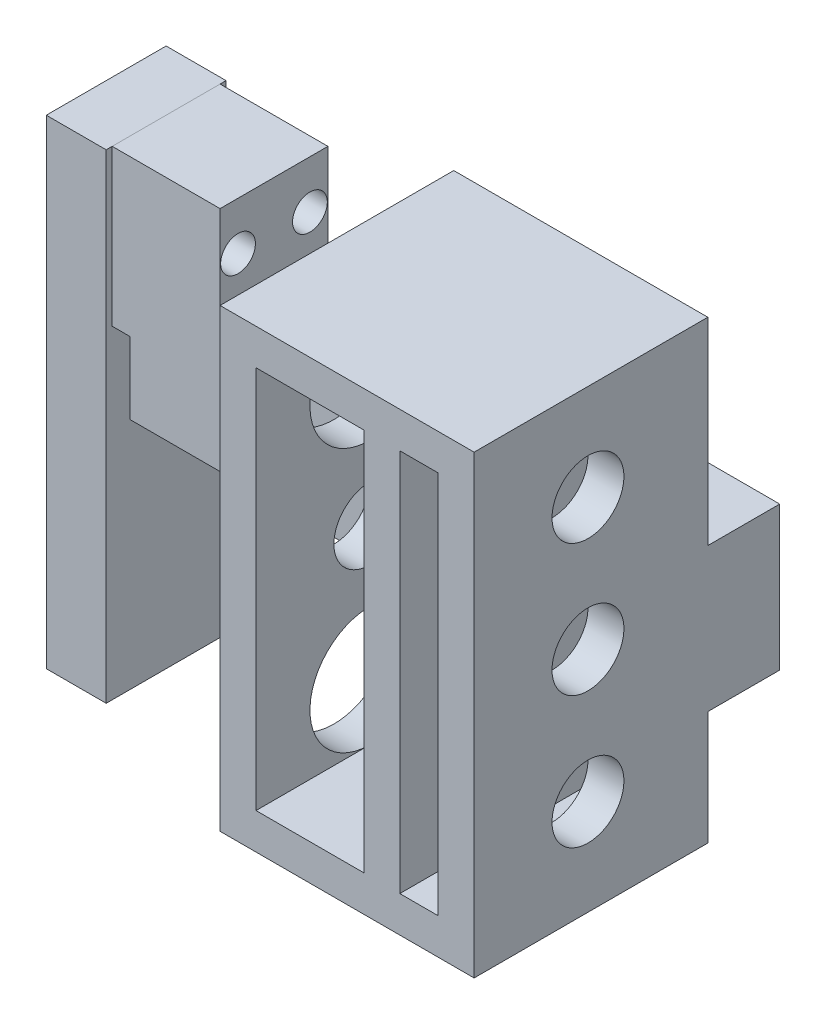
ISO-10303-21;
HEADER;
FILE_DESCRIPTION(('STEP AP214'),'2;1');
FILE_NAME('part.step','',(''),(''),'','','');
FILE_SCHEMA(('AUTOMOTIVE_DESIGN { 1 0 10303 214 1 1 1 1 }'));
ENDSEC;
DATA;
#1=APPLICATION_CONTEXT('core data for automotive mechanical design processes');
#2=APPLICATION_PROTOCOL_DEFINITION('international standard','automotive_design',2000,#1);
#3=PRODUCT_CONTEXT('',#1,'mechanical');
#4=PRODUCT('Part','Part','',(#3));
#5=PRODUCT_RELATED_PRODUCT_CATEGORY('part','',(#4));
#6=PRODUCT_DEFINITION_FORMATION('','',#4);
#7=PRODUCT_DEFINITION_CONTEXT('part definition',#1,'design');
#8=PRODUCT_DEFINITION('design','',#6,#7);
#9=PRODUCT_DEFINITION_SHAPE('','',#8);
#10=(LENGTH_UNIT() NAMED_UNIT(*) SI_UNIT(.MILLI.,.METRE.));
#11=(NAMED_UNIT(*) PLANE_ANGLE_UNIT() SI_UNIT($,.RADIAN.));
#12=(NAMED_UNIT(*) SI_UNIT($,.STERADIAN.) SOLID_ANGLE_UNIT());
#13=UNCERTAINTY_MEASURE_WITH_UNIT(LENGTH_MEASURE(1.E-05),#10,'distance_accuracy_value','');
#14=(GEOMETRIC_REPRESENTATION_CONTEXT(3) GLOBAL_UNCERTAINTY_ASSIGNED_CONTEXT((#13)) GLOBAL_UNIT_ASSIGNED_CONTEXT((#10,
#11,#12)) REPRESENTATION_CONTEXT('',''));
#15=CARTESIAN_POINT('',(0.,0.,0.));
#16=DIRECTION('',(0.,0.,1.));
#17=DIRECTION('',(1.,0.,0.));
#18=AXIS2_PLACEMENT_3D('',#15,#16,#17);
#19=CARTESIAN_POINT('',(0.,0.,40.));
#20=DIRECTION('',(0.,0.,-1.));
#21=DIRECTION('',(1.,0.,0.));
#22=AXIS2_PLACEMENT_3D('',#19,#20,#21);
#23=PLANE('',#22);
#24=DIRECTION('',(0.,-1.,0.));
#25=VECTOR('',#24,1.);
#26=CARTESIAN_POINT('',(-3.2,0.,40.));
#27=LINE('',#26,#25);
#28=CARTESIAN_POINT('',(-3.2,11.5125104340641,40.));
#29=VERTEX_POINT('',#28);
#30=CARTESIAN_POINT('',(-3.2,3.,40.));
#31=VERTEX_POINT('',#30);
#32=EDGE_CURVE('E451',#29,#31,#27,.T.);
#33=ORIENTED_EDGE('',*,*,#32,.T.);
#34=DIRECTION('',(-1.,0.,0.));
#35=VECTOR('',#34,1.);
#36=CARTESIAN_POINT('',(3.,3.,40.));
#37=LINE('',#36,#35);
#38=CARTESIAN_POINT('',(0.,3.,40.));
#39=VERTEX_POINT('',#38);
#40=EDGE_CURVE('E398',#39,#31,#37,.T.);
#41=ORIENTED_EDGE('',*,*,#40,.F.);
#42=DIRECTION('',(0.,-1.,0.));
#43=VECTOR('',#42,1.);
#44=CARTESIAN_POINT('',(0.,0.,40.));
#45=LINE('',#44,#43);
#46=CARTESIAN_POINT('',(0.,11.5125104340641,40.));
#47=VERTEX_POINT('',#46);
#48=EDGE_CURVE('E497',#47,#39,#45,.T.);
#49=ORIENTED_EDGE('',*,*,#48,.F.);
#50=DIRECTION('',(1.,0.,0.));
#51=VECTOR('',#50,1.);
#52=CARTESIAN_POINT('',(-20.0837473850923,11.5125104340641,40.));
#53=LINE('',#52,#51);
#54=EDGE_CURVE('E296',#29,#47,#53,.T.);
#55=ORIENTED_EDGE('',*,*,#54,.F.);
#56=EDGE_LOOP('',(#33,#41,#49,#55));
#57=FACE_BOUND('',#56,.T.);
#58=ADVANCED_FACE('F44',(#57),#23,.F.);
#59=CARTESIAN_POINT('',(0.,0.,37.));
#60=DIRECTION('',(0.,0.,-1.));
#61=DIRECTION('',(1.,0.,0.));
#62=AXIS2_PLACEMENT_3D('',#59,#60,#61);
#63=PLANE('',#62);
#64=DIRECTION('',(0.,-1.,0.));
#65=VECTOR('',#64,1.);
#66=CARTESIAN_POINT('',(-3.2,26.4874895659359,37.));
#67=LINE('',#66,#65);
#68=CARTESIAN_POINT('',(-3.2,26.4874895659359,37.));
#69=VERTEX_POINT('',#68);
#70=CARTESIAN_POINT('',(-3.2,21.5,37.));
#71=VERTEX_POINT('',#70);
#72=EDGE_CURVE('E278',#69,#71,#67,.T.);
#73=ORIENTED_EDGE('',*,*,#72,.T.);
#74=DIRECTION('',(1.,0.,0.));
#75=VECTOR('',#74,1.);
#76=CARTESIAN_POINT('',(0.,21.5,37.));
#77=LINE('',#76,#75);
#78=CARTESIAN_POINT('',(-18.2,21.5,37.));
#79=VERTEX_POINT('',#78);
#80=EDGE_CURVE('E337',#79,#71,#77,.T.);
#81=ORIENTED_EDGE('',*,*,#80,.F.);
#82=DIRECTION('',(0.,-1.,0.));
#83=VECTOR('',#82,1.);
#84=CARTESIAN_POINT('',(-18.2,38.,37.));
#85=LINE('',#84,#83);
#86=CARTESIAN_POINT('',(-18.2,38.,37.));
#87=VERTEX_POINT('',#86);
#88=EDGE_CURVE('E340',#87,#79,#85,.T.);
#89=ORIENTED_EDGE('',*,*,#88,.F.);
#90=DIRECTION('',(-1.,0.,0.));
#91=VECTOR('',#90,1.);
#92=CARTESIAN_POINT('',(-18.2,38.,37.));
#93=LINE('',#92,#91);
#94=CARTESIAN_POINT('',(3.,38.,37.));
#95=VERTEX_POINT('',#94);
#96=EDGE_CURVE('E354',#95,#87,#93,.T.);
#97=ORIENTED_EDGE('',*,*,#96,.F.);
#98=DIRECTION('',(0.,1.,0.));
#99=VECTOR('',#98,1.);
#100=CARTESIAN_POINT('',(3.,38.,37.));
#101=LINE('',#100,#99);
#102=CARTESIAN_POINT('',(3.,21.5,37.));
#103=VERTEX_POINT('',#102);
#104=EDGE_CURVE('E350',#103,#95,#101,.T.);
#105=ORIENTED_EDGE('',*,*,#104,.F.);
#106=CARTESIAN_POINT('',(0.,21.5,37.));
#107=VERTEX_POINT('',#106);
#108=EDGE_CURVE('E336',#107,#103,#77,.T.);
#109=ORIENTED_EDGE('',*,*,#108,.F.);
#110=DIRECTION('',(0.,-1.,0.));
#111=VECTOR('',#110,1.);
#112=CARTESIAN_POINT('',(0.,26.4874895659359,37.));
#113=LINE('',#112,#111);
#114=CARTESIAN_POINT('',(0.,26.4874895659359,37.));
#115=VERTEX_POINT('',#114);
#116=EDGE_CURVE('E281',#115,#107,#113,.T.);
#117=ORIENTED_EDGE('',*,*,#116,.F.);
#118=DIRECTION('',(1.,0.,0.));
#119=VECTOR('',#118,1.);
#120=CARTESIAN_POINT('',(-20.0837473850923,26.4874895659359,37.));
#121=LINE('',#120,#119);
#122=EDGE_CURVE('E268',#69,#115,#121,.T.);
#123=ORIENTED_EDGE('',*,*,#122,.F.);
#124=EDGE_LOOP('',(#73,#81,#89,#97,#105,#109,#117,#123));
#125=FACE_BOUND('',#124,.T.);
#126=ADVANCED_FACE('F276',(#125),#63,.T.);
#127=CARTESIAN_POINT('',(3.,0.,37.));
#128=VERTEX_POINT('',#127);
#129=CARTESIAN_POINT('',(3.,9.5,37.));
#130=VERTEX_POINT('',#129);
#131=EDGE_CURVE('E351',#128,#130,#101,.T.);
#132=ORIENTED_EDGE('',*,*,#131,.F.);
#133=DIRECTION('',(1.,0.,0.));
#134=VECTOR('',#133,1.);
#135=CARTESIAN_POINT('',(-18.2,0.,37.));
#136=LINE('',#135,#134);
#137=CARTESIAN_POINT('',(-18.2,0.,37.));
#138=VERTEX_POINT('',#137);
#139=EDGE_CURVE('E347',#138,#128,#136,.T.);
#140=ORIENTED_EDGE('',*,*,#139,.F.);
#141=DIRECTION('',(0.,-1.,0.));
#142=VECTOR('',#141,1.);
#143=CARTESIAN_POINT('',(-18.2,9.5,37.));
#144=LINE('',#143,#142);
#145=CARTESIAN_POINT('',(-18.2,9.5,37.));
#146=VERTEX_POINT('',#145);
#147=EDGE_CURVE('E343',#146,#138,#144,.T.);
#148=ORIENTED_EDGE('',*,*,#147,.F.);
#149=DIRECTION('',(-1.,0.,0.));
#150=VECTOR('',#149,1.);
#151=CARTESIAN_POINT('',(0.,9.5,37.));
#152=LINE('',#151,#150);
#153=EDGE_CURVE('E333',#130,#146,#152,.T.);
#154=ORIENTED_EDGE('',*,*,#153,.F.);
#155=EDGE_LOOP('',(#132,#140,#148,#154));
#156=FACE_BOUND('',#155,.T.);
#157=ADVANCED_FACE('F573',(#156),#63,.T.);
#158=CARTESIAN_POINT('',(3.,35.,56.5));
#159=DIRECTION('',(0.,-1.,0.));
#160=DIRECTION('',(0.,0.,1.));
#161=AXIS2_PLACEMENT_3D('',#158,#159,#160);
#162=PLANE('',#161);
#163=DIRECTION('',(1.,0.,0.));
#164=VECTOR('',#163,1.);
#165=CARTESIAN_POINT('',(3.,35.,40.));
#166=LINE('',#165,#164);
#167=CARTESIAN_POINT('',(-15.2,35.,40.));
#168=VERTEX_POINT('',#167);
#169=CARTESIAN_POINT('',(-6.2,35.,40.));
#170=VERTEX_POINT('',#169);
#171=EDGE_CURVE('E467',#168,#170,#166,.T.);
#172=ORIENTED_EDGE('',*,*,#171,.T.);
#173=DIRECTION('',(0.,0.,1.));
#174=VECTOR('',#173,1.);
#175=CARTESIAN_POINT('',(-6.2,35.,56.5));
#176=LINE('',#175,#174);
#177=CARTESIAN_POINT('',(-6.2,35.,47.));
#178=VERTEX_POINT('',#177);
#179=EDGE_CURVE('E524',#170,#178,#176,.T.);
#180=ORIENTED_EDGE('',*,*,#179,.T.);
#181=CARTESIAN_POINT('',(-6.2,35.,56.5));
#182=VERTEX_POINT('',#181);
#183=EDGE_CURVE('E521',#178,#182,#176,.T.);
#184=ORIENTED_EDGE('',*,*,#183,.T.);
#185=DIRECTION('',(1.,0.,0.));
#186=VECTOR('',#185,1.);
#187=CARTESIAN_POINT('',(3.,35.,56.5));
#188=LINE('',#187,#186);
#189=CARTESIAN_POINT('',(-15.2,35.,56.5));
#190=VERTEX_POINT('',#189);
#191=EDGE_CURVE('E468',#190,#182,#188,.T.);
#192=ORIENTED_EDGE('',*,*,#191,.F.);
#193=DIRECTION('',(0.,0.,1.));
#194=VECTOR('',#193,1.);
#195=CARTESIAN_POINT('',(-15.2,35.,56.5));
#196=LINE('',#195,#194);
#197=CARTESIAN_POINT('',(-15.2,35.,47.));
#198=VERTEX_POINT('',#197);
#199=EDGE_CURVE('E48',#198,#190,#196,.T.);
#200=ORIENTED_EDGE('',*,*,#199,.F.);
#201=EDGE_CURVE('E12',#168,#198,#196,.T.);
#202=ORIENTED_EDGE('',*,*,#201,.F.);
#203=EDGE_LOOP('',(#172,#180,#184,#192,#200,#202));
#204=FACE_BOUND('',#203,.T.);
#205=ADVANCED_FACE('F539',(#204),#162,.T.);
#206=CARTESIAN_POINT('',(-3.2,35.,40.));
#207=VERTEX_POINT('',#206);
#208=CARTESIAN_POINT('',(0.,35.,40.));
#209=VERTEX_POINT('',#208);
#210=EDGE_CURVE('E474',#207,#209,#166,.T.);
#211=ORIENTED_EDGE('',*,*,#210,.T.);
#212=DIRECTION('',(0.,0.,-1.));
#213=VECTOR('',#212,1.);
#214=CARTESIAN_POINT('',(0.,35.,40.));
#215=LINE('',#214,#213);
#216=CARTESIAN_POINT('',(0.,35.,56.5));
#217=VERTEX_POINT('',#216);
#218=EDGE_CURVE('E478',#217,#209,#215,.T.);
#219=ORIENTED_EDGE('',*,*,#218,.F.);
#220=CARTESIAN_POINT('',(-3.2,35.,56.5));
#221=VERTEX_POINT('',#220);
#222=EDGE_CURVE('E466',#221,#217,#188,.T.);
#223=ORIENTED_EDGE('',*,*,#222,.F.);
#224=DIRECTION('',(0.,0.,1.));
#225=VECTOR('',#224,1.);
#226=CARTESIAN_POINT('',(-3.2,35.,56.5));
#227=LINE('',#226,#225);
#228=CARTESIAN_POINT('',(-3.2,35.,47.));
#229=VERTEX_POINT('',#228);
#230=EDGE_CURVE('E519',#229,#221,#227,.T.);
#231=ORIENTED_EDGE('',*,*,#230,.F.);
#232=EDGE_CURVE('E522',#207,#229,#227,.T.);
#233=ORIENTED_EDGE('',*,*,#232,.F.);
#234=EDGE_LOOP('',(#211,#219,#223,#231,#233));
#235=FACE_BOUND('',#234,.T.);
#236=ADVANCED_FACE('F669',(#235),#162,.T.);
#237=CARTESIAN_POINT('',(3.,0.,40.));
#238=DIRECTION('',(-1.,0.,0.));
#239=DIRECTION('',(0.,0.,-1.));
#240=AXIS2_PLACEMENT_3D('',#237,#238,#239);
#241=PLANE('',#240);
#242=ORIENTED_EDGE('',*,*,#104,.T.);
#243=DIRECTION('',(0.,0.,-1.));
#244=VECTOR('',#243,1.);
#245=CARTESIAN_POINT('',(3.,38.,40.));
#246=LINE('',#245,#244);
#247=CARTESIAN_POINT('',(3.,38.,56.5));
#248=VERTEX_POINT('',#247);
#249=EDGE_CURVE('E507',#248,#95,#246,.T.);
#250=ORIENTED_EDGE('',*,*,#249,.F.);
#251=DIRECTION('',(0.,1.,0.));
#252=VECTOR('',#251,1.);
#253=CARTESIAN_POINT('',(3.,0.,56.5));
#254=LINE('',#253,#252);
#255=CARTESIAN_POINT('',(3.,0.,56.5));
#256=VERTEX_POINT('',#255);
#257=EDGE_CURVE('E503',#256,#248,#254,.T.);
#258=ORIENTED_EDGE('',*,*,#257,.F.);
#259=DIRECTION('',(0.,0.,1.));
#260=VECTOR('',#259,1.);
#261=CARTESIAN_POINT('',(3.,0.,40.));
#262=LINE('',#261,#260);
#263=EDGE_CURVE('E500',#128,#256,#262,.T.);
#264=ORIENTED_EDGE('',*,*,#263,.F.);
#265=ORIENTED_EDGE('',*,*,#131,.T.);
#266=DIRECTION('',(0.,0.,1.));
#267=VECTOR('',#266,1.);
#268=CARTESIAN_POINT('',(3.,9.5,31.));
#269=LINE('',#268,#267);
#270=CARTESIAN_POINT('',(3.,9.5,31.));
#271=VERTEX_POINT('',#270);
#272=EDGE_CURVE('E331',#271,#130,#269,.T.);
#273=ORIENTED_EDGE('',*,*,#272,.F.);
#274=DIRECTION('',(0.,1.,0.));
#275=VECTOR('',#274,1.);
#276=CARTESIAN_POINT('',(3.,21.5,31.));
#277=LINE('',#276,#275);
#278=CARTESIAN_POINT('',(3.,21.5,31.));
#279=VERTEX_POINT('',#278);
#280=EDGE_CURVE('E326',#271,#279,#277,.T.);
#281=ORIENTED_EDGE('',*,*,#280,.T.);
#282=DIRECTION('',(0.,0.,1.));
#283=VECTOR('',#282,1.);
#284=CARTESIAN_POINT('',(3.,21.5,31.));
#285=LINE('',#284,#283);
#286=EDGE_CURVE('E329',#279,#103,#285,.T.);
#287=ORIENTED_EDGE('',*,*,#286,.T.);
#288=EDGE_LOOP('',(#242,#250,#258,#264,#265,#273,#281,#287));
#289=FACE_BOUND('',#288,.T.);
#290=CARTESIAN_POINT('',(3.,8.,47.));
#291=DIRECTION('',(-1.,0.,0.));
#292=DIRECTION('',(0.,0.,-1.));
#293=AXIS2_PLACEMENT_3D('',#290,#291,#292);
#294=CIRCLE('',#293,3.);
#295=CARTESIAN_POINT('',(3.,8.,44.));
#296=VERTEX_POINT('',#295);
#297=EDGE_CURVE('E482',#296,#296,#294,.T.);
#298=ORIENTED_EDGE('',*,*,#297,.T.);
#299=EDGE_LOOP('',(#298));
#300=FACE_BOUND('',#299,.T.);
#301=CARTESIAN_POINT('',(3.,30.,47.));
#302=DIRECTION('',(-1.,0.,0.));
#303=DIRECTION('',(0.,0.,1.));
#304=AXIS2_PLACEMENT_3D('',#301,#302,#303);
#305=CIRCLE('',#304,3.);
#306=CARTESIAN_POINT('',(3.,30.,50.));
#307=VERTEX_POINT('',#306);
#308=EDGE_CURVE('E488',#307,#307,#305,.T.);
#309=ORIENTED_EDGE('',*,*,#308,.T.);
#310=EDGE_LOOP('',(#309));
#311=FACE_BOUND('',#310,.T.);
#312=CARTESIAN_POINT('',(3.,19.,47.));
#313=DIRECTION('',(-1.,0.,0.));
#314=DIRECTION('',(0.,0.,1.));
#315=AXIS2_PLACEMENT_3D('',#312,#313,#314);
#316=CIRCLE('',#315,3.);
#317=CARTESIAN_POINT('',(3.,19.,50.));
#318=VERTEX_POINT('',#317);
#319=EDGE_CURVE('E494',#318,#318,#316,.T.);
#320=ORIENTED_EDGE('',*,*,#319,.T.);
#321=EDGE_LOOP('',(#320));
#322=FACE_BOUND('',#321,.T.);
#323=ADVANCED_FACE('F644',(#289,#300,#311,#322),#241,.F.);
#324=CARTESIAN_POINT('',(0.,0.,40.));
#325=DIRECTION('',(-1.,0.,0.));
#326=DIRECTION('',(0.,0.,-1.));
#327=AXIS2_PLACEMENT_3D('',#324,#325,#326);
#328=PLANE('',#327);
#329=ORIENTED_EDGE('',*,*,#48,.T.);
#330=DIRECTION('',(0.,0.,1.));
#331=VECTOR('',#330,1.);
#332=CARTESIAN_POINT('',(0.,3.,40.));
#333=LINE('',#332,#331);
#334=CARTESIAN_POINT('',(0.,3.,56.5));
#335=VERTEX_POINT('',#334);
#336=EDGE_CURVE('E409',#39,#335,#333,.T.);
#337=ORIENTED_EDGE('',*,*,#336,.T.);
#338=DIRECTION('',(0.,1.,0.));
#339=VECTOR('',#338,1.);
#340=CARTESIAN_POINT('',(0.,0.,56.5));
#341=LINE('',#340,#339);
#342=EDGE_CURVE('E504',#335,#217,#341,.T.);
#343=ORIENTED_EDGE('',*,*,#342,.T.);
#344=ORIENTED_EDGE('',*,*,#218,.T.);
#345=CARTESIAN_POINT('',(0.,26.4874895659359,40.));
#346=VERTEX_POINT('',#345);
#347=EDGE_CURVE('E510',#209,#346,#45,.T.);
#348=ORIENTED_EDGE('',*,*,#347,.T.);
#349=DIRECTION('',(0.,0.,-1.));
#350=VECTOR('',#349,1.);
#351=CARTESIAN_POINT('',(0.,26.4874895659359,40.));
#352=LINE('',#351,#350);
#353=EDGE_CURVE('E918',#346,#115,#352,.T.);
#354=ORIENTED_EDGE('',*,*,#353,.T.);
#355=ORIENTED_EDGE('',*,*,#116,.T.);
#356=CARTESIAN_POINT('',(0.,21.25,37.));
#357=VERTEX_POINT('',#356);
#358=EDGE_CURVE('E921',#107,#357,#113,.T.);
#359=ORIENTED_EDGE('',*,*,#358,.T.);
#360=DIRECTION('',(0.,0.,-1.));
#361=VECTOR('',#360,1.);
#362=CARTESIAN_POINT('',(0.,21.25,37.));
#363=LINE('',#362,#361);
#364=CARTESIAN_POINT('',(0.,21.25,34.));
#365=VERTEX_POINT('',#364);
#366=EDGE_CURVE('E937',#357,#365,#363,.T.);
#367=ORIENTED_EDGE('',*,*,#366,.T.);
#368=DIRECTION('',(0.,-1.,0.));
#369=VECTOR('',#368,1.);
#370=CARTESIAN_POINT('',(0.,16.75,34.));
#371=LINE('',#370,#369);
#372=CARTESIAN_POINT('',(0.,16.75,34.));
#373=VERTEX_POINT('',#372);
#374=EDGE_CURVE('E934',#365,#373,#371,.T.);
#375=ORIENTED_EDGE('',*,*,#374,.T.);
#376=DIRECTION('',(0.,0.,1.));
#377=VECTOR('',#376,1.);
#378=CARTESIAN_POINT('',(0.,16.75,37.));
#379=LINE('',#378,#377);
#380=CARTESIAN_POINT('',(0.,16.75,37.));
#381=VERTEX_POINT('',#380);
#382=EDGE_CURVE('E931',#373,#381,#379,.T.);
#383=ORIENTED_EDGE('',*,*,#382,.T.);
#384=DIRECTION('',(0.,-1.,0.));
#385=VECTOR('',#384,1.);
#386=CARTESIAN_POINT('',(0.,11.5125104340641,37.));
#387=LINE('',#386,#385);
#388=CARTESIAN_POINT('',(0.,11.5125104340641,37.));
#389=VERTEX_POINT('',#388);
#390=EDGE_CURVE('E928',#381,#389,#387,.T.);
#391=ORIENTED_EDGE('',*,*,#390,.T.);
#392=DIRECTION('',(0.,0.,1.));
#393=VECTOR('',#392,1.);
#394=CARTESIAN_POINT('',(0.,11.5125104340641,40.));
#395=LINE('',#394,#393);
#396=EDGE_CURVE('E272',#389,#47,#395,.T.);
#397=ORIENTED_EDGE('',*,*,#396,.T.);
#398=EDGE_LOOP('',(#329,#337,#343,#344,#348,#354,#355,#359,#367,#375,#383,#391,#397));
#399=FACE_BOUND('',#398,.T.);
#400=CARTESIAN_POINT('',(0.,30.,47.));
#401=DIRECTION('',(-1.,0.,0.));
#402=DIRECTION('',(0.,0.,1.));
#403=AXIS2_PLACEMENT_3D('',#400,#401,#402);
#404=CIRCLE('',#403,3.);
#405=CARTESIAN_POINT('',(0.,30.,50.));
#406=VERTEX_POINT('',#405);
#407=EDGE_CURVE('E485',#406,#406,#404,.T.);
#408=ORIENTED_EDGE('',*,*,#407,.F.);
#409=EDGE_LOOP('',(#408));
#410=FACE_BOUND('',#409,.T.);
#411=CARTESIAN_POINT('',(0.,19.,47.));
#412=DIRECTION('',(-1.,0.,0.));
#413=DIRECTION('',(0.,0.,1.));
#414=AXIS2_PLACEMENT_3D('',#411,#412,#413);
#415=CIRCLE('',#414,3.);
#416=CARTESIAN_POINT('',(0.,19.,50.));
#417=VERTEX_POINT('',#416);
#418=EDGE_CURVE('E491',#417,#417,#415,.T.);
#419=ORIENTED_EDGE('',*,*,#418,.F.);
#420=EDGE_LOOP('',(#419));
#421=FACE_BOUND('',#420,.T.);
#422=CARTESIAN_POINT('',(0.,8.,47.));
#423=DIRECTION('',(-1.,0.,0.));
#424=DIRECTION('',(0.,0.,-1.));
#425=AXIS2_PLACEMENT_3D('',#422,#423,#424);
#426=CIRCLE('',#425,3.);
#427=CARTESIAN_POINT('',(0.,8.,44.));
#428=VERTEX_POINT('',#427);
#429=EDGE_CURVE('E481',#428,#428,#426,.T.);
#430=ORIENTED_EDGE('',*,*,#429,.F.);
#431=EDGE_LOOP('',(#430));
#432=FACE_BOUND('',#431,.T.);
#433=ADVANCED_FACE('F661',(#399,#410,#421,#432),#328,.T.);
#434=CARTESIAN_POINT('',(3.,0.,40.));
#435=DIRECTION('',(0.,1.,0.));
#436=DIRECTION('',(0.,0.,-1.));
#437=AXIS2_PLACEMENT_3D('',#434,#435,#436);
#438=PLANE('',#437);
#439=ORIENTED_EDGE('',*,*,#263,.T.);
#440=DIRECTION('',(-1.,0.,0.));
#441=VECTOR('',#440,1.);
#442=CARTESIAN_POINT('',(3.,0.,56.5));
#443=LINE('',#442,#441);
#444=CARTESIAN_POINT('',(-18.2,0.,56.5));
#445=VERTEX_POINT('',#444);
#446=EDGE_CURVE('E516',#256,#445,#443,.T.);
#447=ORIENTED_EDGE('',*,*,#446,.T.);
#448=DIRECTION('',(0.,0.,1.));
#449=VECTOR('',#448,1.);
#450=CARTESIAN_POINT('',(-18.2,0.,40.));
#451=LINE('',#450,#449);
#452=EDGE_CURVE('E427',#138,#445,#451,.T.);
#453=ORIENTED_EDGE('',*,*,#452,.F.);
#454=ORIENTED_EDGE('',*,*,#139,.T.);
#455=EDGE_LOOP('',(#439,#447,#453,#454));
#456=FACE_BOUND('',#455,.T.);
#457=ADVANCED_FACE('F46',(#456),#438,.F.);
#458=CARTESIAN_POINT('',(3.,0.,56.5));
#459=DIRECTION('',(0.,0.,-1.));
#460=DIRECTION('',(1.,0.,0.));
#461=AXIS2_PLACEMENT_3D('',#458,#459,#460);
#462=PLANE('',#461);
#463=DIRECTION('',(-1.,0.,0.));
#464=VECTOR('',#463,1.);
#465=CARTESIAN_POINT('',(3.,3.,56.5));
#466=LINE('',#465,#464);
#467=CARTESIAN_POINT('',(-3.2,3.,56.5));
#468=VERTEX_POINT('',#467);
#469=EDGE_CURVE('E397',#335,#468,#466,.T.);
#470=ORIENTED_EDGE('',*,*,#469,.T.);
#471=DIRECTION('',(0.,1.,0.));
#472=VECTOR('',#471,1.);
#473=CARTESIAN_POINT('',(-3.2,0.,56.5));
#474=LINE('',#473,#472);
#475=EDGE_CURVE('E458',#468,#221,#474,.T.);
#476=ORIENTED_EDGE('',*,*,#475,.T.);
#477=ORIENTED_EDGE('',*,*,#222,.T.);
#478=ORIENTED_EDGE('',*,*,#342,.F.);
#479=EDGE_LOOP('',(#470,#476,#477,#478));
#480=FACE_BOUND('',#479,.T.);
#481=CARTESIAN_POINT('',(-6.2,3.,56.5));
#482=VERTEX_POINT('',#481);
#483=CARTESIAN_POINT('',(-15.2,3.,56.5));
#484=VERTEX_POINT('',#483);
#485=EDGE_CURVE('E394',#482,#484,#466,.T.);
#486=ORIENTED_EDGE('',*,*,#485,.T.);
#487=DIRECTION('',(0.,1.,0.));
#488=VECTOR('',#487,1.);
#489=CARTESIAN_POINT('',(-15.2,0.,56.5));
#490=LINE('',#489,#488);
#491=EDGE_CURVE('E433',#484,#190,#490,.T.);
#492=ORIENTED_EDGE('',*,*,#491,.T.);
#493=ORIENTED_EDGE('',*,*,#191,.T.);
#494=DIRECTION('',(0.,1.,0.));
#495=VECTOR('',#494,1.);
#496=CARTESIAN_POINT('',(-6.2,0.,56.5));
#497=LINE('',#496,#495);
#498=EDGE_CURVE('E457',#482,#182,#497,.T.);
#499=ORIENTED_EDGE('',*,*,#498,.F.);
#500=EDGE_LOOP('',(#486,#492,#493,#499));
#501=FACE_BOUND('',#500,.T.);
#502=DIRECTION('',(-1.,0.,0.));
#503=VECTOR('',#502,1.);
#504=CARTESIAN_POINT('',(3.,38.,56.5));
#505=LINE('',#504,#503);
#506=CARTESIAN_POINT('',(-18.2,38.,56.5));
#507=VERTEX_POINT('',#506);
#508=EDGE_CURVE('E509',#248,#507,#505,.T.);
#509=ORIENTED_EDGE('',*,*,#508,.T.);
#510=DIRECTION('',(0.,-1.,0.));
#511=VECTOR('',#510,1.);
#512=CARTESIAN_POINT('',(-18.2,38.,56.5));
#513=LINE('',#512,#511);
#514=EDGE_CURVE('E464',#507,#445,#513,.T.);
#515=ORIENTED_EDGE('',*,*,#514,.T.);
#516=ORIENTED_EDGE('',*,*,#446,.F.);
#517=ORIENTED_EDGE('',*,*,#257,.T.);
#518=EDGE_LOOP('',(#509,#515,#516,#517));
#519=FACE_BOUND('',#518,.T.);
#520=ADVANCED_FACE('F542',(#480,#501,#519),#462,.F.);
#521=CARTESIAN_POINT('',(3.,38.,40.));
#522=DIRECTION('',(0.,-1.,0.));
#523=DIRECTION('',(0.,0.,1.));
#524=AXIS2_PLACEMENT_3D('',#521,#522,#523);
#525=PLANE('',#524);
#526=DIRECTION('',(0.,0.,-1.));
#527=VECTOR('',#526,1.);
#528=CARTESIAN_POINT('',(-18.2,38.,56.5));
#529=LINE('',#528,#527);
#530=EDGE_CURVE('E471',#507,#87,#529,.T.);
#531=ORIENTED_EDGE('',*,*,#530,.F.);
#532=ORIENTED_EDGE('',*,*,#508,.F.);
#533=ORIENTED_EDGE('',*,*,#249,.T.);
#534=ORIENTED_EDGE('',*,*,#96,.T.);
#535=EDGE_LOOP('',(#531,#532,#533,#534));
#536=FACE_BOUND('',#535,.T.);
#537=ADVANCED_FACE('F639',(#536),#525,.F.);
#538=CARTESIAN_POINT('',(3.,19.,47.));
#539=DIRECTION('',(-1.,0.,0.));
#540=DIRECTION('',(0.,0.,-1.));
#541=AXIS2_PLACEMENT_3D('',#538,#539,#540);
#542=CYLINDRICAL_SURFACE('',#541,3.);
#543=ORIENTED_EDGE('',*,*,#319,.F.);
#544=EDGE_LOOP('',(#543));
#545=FACE_BOUND('',#544,.T.);
#546=ORIENTED_EDGE('',*,*,#418,.T.);
#547=EDGE_LOOP('',(#546));
#548=FACE_BOUND('',#547,.T.);
#549=ADVANCED_FACE('F659',(#545,#548),#542,.F.);
#550=CARTESIAN_POINT('',(3.,30.,47.));
#551=DIRECTION('',(-1.,0.,0.));
#552=DIRECTION('',(0.,0.,-1.));
#553=AXIS2_PLACEMENT_3D('',#550,#551,#552);
#554=CYLINDRICAL_SURFACE('',#553,3.);
#555=ORIENTED_EDGE('',*,*,#308,.F.);
#556=EDGE_LOOP('',(#555));
#557=FACE_BOUND('',#556,.T.);
#558=ORIENTED_EDGE('',*,*,#407,.T.);
#559=EDGE_LOOP('',(#558));
#560=FACE_BOUND('',#559,.T.);
#561=ADVANCED_FACE('F672',(#557,#560),#554,.F.);
#562=CARTESIAN_POINT('',(3.,8.,47.));
#563=DIRECTION('',(-1.,0.,0.));
#564=DIRECTION('',(0.,0.,-1.));
#565=AXIS2_PLACEMENT_3D('',#562,#563,#564);
#566=CYLINDRICAL_SURFACE('',#565,3.);
#567=ORIENTED_EDGE('',*,*,#297,.F.);
#568=EDGE_LOOP('',(#567));
#569=FACE_BOUND('',#568,.T.);
#570=ORIENTED_EDGE('',*,*,#429,.T.);
#571=EDGE_LOOP('',(#570));
#572=FACE_BOUND('',#571,.T.);
#573=ADVANCED_FACE('F676',(#569,#572),#566,.F.);
#574=CARTESIAN_POINT('',(-18.2,38.,56.5));
#575=DIRECTION('',(-1.,0.,0.));
#576=DIRECTION('',(0.,0.,-1.));
#577=AXIS2_PLACEMENT_3D('',#574,#575,#576);
#578=PLANE('',#577);
#579=CARTESIAN_POINT('',(-18.2,8.00000000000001,47.));
#580=DIRECTION('',(-1.,0.,0.));
#581=DIRECTION('',(0.,0.,-1.));
#582=AXIS2_PLACEMENT_3D('',#579,#580,#581);
#583=CIRCLE('',#582,5.);
#584=CARTESIAN_POINT('',(-18.2,8.00000000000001,42.));
#585=VERTEX_POINT('',#584);
#586=EDGE_CURVE('E412',#585,#585,#583,.T.);
#587=ORIENTED_EDGE('',*,*,#586,.F.);
#588=EDGE_LOOP('',(#587));
#589=FACE_BOUND('',#588,.T.);
#590=ORIENTED_EDGE('',*,*,#452,.T.);
#591=ORIENTED_EDGE('',*,*,#514,.F.);
#592=ORIENTED_EDGE('',*,*,#530,.T.);
#593=ORIENTED_EDGE('',*,*,#88,.T.);
#594=DIRECTION('',(0.,0.,1.));
#595=VECTOR('',#594,1.);
#596=CARTESIAN_POINT('',(-18.2,21.5,37.));
#597=LINE('',#596,#595);
#598=CARTESIAN_POINT('',(-18.2,21.5,40.));
#599=VERTEX_POINT('',#598);
#600=EDGE_CURVE('E390',#79,#599,#597,.T.);
#601=ORIENTED_EDGE('',*,*,#600,.T.);
#602=DIRECTION('',(0.,-1.,0.));
#603=VECTOR('',#602,1.);
#604=CARTESIAN_POINT('',(-18.2,38.,40.));
#605=LINE('',#604,#603);
#606=CARTESIAN_POINT('',(-18.2,9.5,40.));
#607=VERTEX_POINT('',#606);
#608=EDGE_CURVE('E460',#599,#607,#605,.T.);
#609=ORIENTED_EDGE('',*,*,#608,.T.);
#610=DIRECTION('',(0.,0.,1.));
#611=VECTOR('',#610,1.);
#612=CARTESIAN_POINT('',(-18.2,9.5,37.));
#613=LINE('',#612,#611);
#614=EDGE_CURVE('E357',#146,#607,#613,.T.);
#615=ORIENTED_EDGE('',*,*,#614,.F.);
#616=ORIENTED_EDGE('',*,*,#147,.T.);
#617=EDGE_LOOP('',(#590,#591,#592,#593,#601,#609,#615,#616));
#618=FACE_BOUND('',#617,.T.);
#619=CARTESIAN_POINT('',(-18.2,30.,47.));
#620=DIRECTION('',(-1.,0.,0.));
#621=DIRECTION('',(0.,0.,1.));
#622=AXIS2_PLACEMENT_3D('',#619,#620,#621);
#623=CIRCLE('',#622,5.);
#624=CARTESIAN_POINT('',(-18.2,30.,52.));
#625=VERTEX_POINT('',#624);
#626=EDGE_CURVE('E416',#625,#625,#623,.T.);
#627=ORIENTED_EDGE('',*,*,#626,.F.);
#628=EDGE_LOOP('',(#627));
#629=FACE_BOUND('',#628,.T.);
#630=CARTESIAN_POINT('',(-18.2,19.,47.));
#631=DIRECTION('',(-1.,0.,0.));
#632=DIRECTION('',(0.,0.,1.));
#633=AXIS2_PLACEMENT_3D('',#630,#631,#632);
#634=CIRCLE('',#633,3.);
#635=CARTESIAN_POINT('',(-18.2,19.,50.));
#636=VERTEX_POINT('',#635);
#637=EDGE_CURVE('E421',#636,#636,#634,.T.);
#638=ORIENTED_EDGE('',*,*,#637,.F.);
#639=EDGE_LOOP('',(#638));
#640=FACE_BOUND('',#639,.T.);
#641=ADVANCED_FACE('F631',(#589,#618,#629,#640),#578,.T.);
#642=CARTESIAN_POINT('',(-6.2,0.,40.));
#643=DIRECTION('',(-1.,0.,0.));
#644=DIRECTION('',(0.,0.,-1.));
#645=AXIS2_PLACEMENT_3D('',#642,#643,#644);
#646=PLANE('',#645);
#647=DIRECTION('',(0.,0.,1.));
#648=VECTOR('',#647,1.);
#649=CARTESIAN_POINT('',(-6.2,3.,40.));
#650=LINE('',#649,#648);
#651=CARTESIAN_POINT('',(-6.2,3.,40.));
#652=VERTEX_POINT('',#651);
#653=CARTESIAN_POINT('',(-6.2,3.,47.));
#654=VERTEX_POINT('',#653);
#655=EDGE_CURVE('E408',#652,#654,#650,.T.);
#656=ORIENTED_EDGE('',*,*,#655,.T.);
#657=CARTESIAN_POINT('',(-6.2,8.00000000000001,47.));
#658=DIRECTION('',(-1.,0.,0.));
#659=DIRECTION('',(0.,0.,-1.));
#660=AXIS2_PLACEMENT_3D('',#657,#658,#659);
#661=CIRCLE('',#660,5.);
#662=EDGE_CURVE('E438',#654,#654,#661,.T.);
#663=ORIENTED_EDGE('',*,*,#662,.F.);
#664=EDGE_CURVE('E405',#654,#482,#650,.T.);
#665=ORIENTED_EDGE('',*,*,#664,.T.);
#666=ORIENTED_EDGE('',*,*,#498,.T.);
#667=ORIENTED_EDGE('',*,*,#183,.F.);
#668=CARTESIAN_POINT('',(-6.2,30.,47.));
#669=DIRECTION('',(-1.,0.,0.));
#670=DIRECTION('',(0.,0.,1.));
#671=AXIS2_PLACEMENT_3D('',#668,#669,#670);
#672=CIRCLE('',#671,5.);
#673=EDGE_CURVE('E444',#178,#178,#672,.T.);
#674=ORIENTED_EDGE('',*,*,#673,.F.);
#675=ORIENTED_EDGE('',*,*,#179,.F.);
#676=DIRECTION('',(0.,-1.,0.));
#677=VECTOR('',#676,1.);
#678=CARTESIAN_POINT('',(-6.2,0.,40.));
#679=LINE('',#678,#677);
#680=EDGE_CURVE('E454',#170,#652,#679,.T.);
#681=ORIENTED_EDGE('',*,*,#680,.T.);
#682=EDGE_LOOP('',(#656,#663,#665,#666,#667,#674,#675,#681));
#683=FACE_BOUND('',#682,.T.);
#684=CARTESIAN_POINT('',(-6.2,19.,47.));
#685=DIRECTION('',(-1.,0.,0.));
#686=DIRECTION('',(0.,0.,1.));
#687=AXIS2_PLACEMENT_3D('',#684,#685,#686);
#688=CIRCLE('',#687,4.);
#689=CARTESIAN_POINT('',(-6.2,19.,51.));
#690=VERTEX_POINT('',#689);
#691=EDGE_CURVE('E448',#690,#690,#688,.T.);
#692=ORIENTED_EDGE('',*,*,#691,.F.);
#693=EDGE_LOOP('',(#692));
#694=FACE_BOUND('',#693,.T.);
#695=ADVANCED_FACE('F683',(#683,#694),#646,.T.);
#696=CARTESIAN_POINT('',(-3.2,0.,40.));
#697=DIRECTION('',(-1.,0.,0.));
#698=DIRECTION('',(0.,0.,-1.));
#699=AXIS2_PLACEMENT_3D('',#696,#697,#698);
#700=PLANE('',#699);
#701=DIRECTION('',(0.,0.,1.));
#702=VECTOR('',#701,1.);
#703=CARTESIAN_POINT('',(-3.2,11.5125104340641,40.));
#704=LINE('',#703,#702);
#705=CARTESIAN_POINT('',(-3.2,11.5125104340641,37.));
#706=VERTEX_POINT('',#705);
#707=EDGE_CURVE('E299',#706,#29,#704,.T.);
#708=ORIENTED_EDGE('',*,*,#707,.F.);
#709=DIRECTION('',(0.,-1.,0.));
#710=VECTOR('',#709,1.);
#711=CARTESIAN_POINT('',(-3.2,11.5125104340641,37.));
#712=LINE('',#711,#710);
#713=CARTESIAN_POINT('',(-3.2,16.75,37.));
#714=VERTEX_POINT('',#713);
#715=EDGE_CURVE('E302',#714,#706,#712,.T.);
#716=ORIENTED_EDGE('',*,*,#715,.F.);
#717=DIRECTION('',(0.,0.,1.));
#718=VECTOR('',#717,1.);
#719=CARTESIAN_POINT('',(-3.2,16.75,37.));
#720=LINE('',#719,#718);
#721=CARTESIAN_POINT('',(-3.2,16.75,34.));
#722=VERTEX_POINT('',#721);
#723=EDGE_CURVE('E305',#722,#714,#720,.T.);
#724=ORIENTED_EDGE('',*,*,#723,.F.);
#725=DIRECTION('',(0.,-1.,0.));
#726=VECTOR('',#725,1.);
#727=CARTESIAN_POINT('',(-3.2,16.75,34.));
#728=LINE('',#727,#726);
#729=CARTESIAN_POINT('',(-3.2,21.25,34.));
#730=VERTEX_POINT('',#729);
#731=EDGE_CURVE('E308',#730,#722,#728,.T.);
#732=ORIENTED_EDGE('',*,*,#731,.F.);
#733=DIRECTION('',(0.,0.,-1.));
#734=VECTOR('',#733,1.);
#735=CARTESIAN_POINT('',(-3.2,21.25,37.));
#736=LINE('',#735,#734);
#737=CARTESIAN_POINT('',(-3.2,21.25,37.));
#738=VERTEX_POINT('',#737);
#739=EDGE_CURVE('E291',#738,#730,#736,.T.);
#740=ORIENTED_EDGE('',*,*,#739,.F.);
#741=EDGE_CURVE('E282',#71,#738,#67,.T.);
#742=ORIENTED_EDGE('',*,*,#741,.F.);
#743=ORIENTED_EDGE('',*,*,#72,.F.);
#744=DIRECTION('',(0.,0.,-1.));
#745=VECTOR('',#744,1.);
#746=CARTESIAN_POINT('',(-3.2,26.4874895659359,40.));
#747=LINE('',#746,#745);
#748=CARTESIAN_POINT('',(-3.2,26.4874895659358,40.));
#749=VERTEX_POINT('',#748);
#750=EDGE_CURVE('E265',#749,#69,#747,.T.);
#751=ORIENTED_EDGE('',*,*,#750,.F.);
#752=EDGE_CURVE('E461',#207,#749,#27,.T.);
#753=ORIENTED_EDGE('',*,*,#752,.F.);
#754=ORIENTED_EDGE('',*,*,#232,.T.);
#755=CARTESIAN_POINT('',(-3.2,30.,47.));
#756=DIRECTION('',(-1.,0.,0.));
#757=DIRECTION('',(0.,0.,1.));
#758=AXIS2_PLACEMENT_3D('',#755,#756,#757);
#759=CIRCLE('',#758,5.);
#760=EDGE_CURVE('E441',#229,#229,#759,.T.);
#761=ORIENTED_EDGE('',*,*,#760,.T.);
#762=ORIENTED_EDGE('',*,*,#230,.T.);
#763=ORIENTED_EDGE('',*,*,#475,.F.);
#764=DIRECTION('',(0.,0.,1.));
#765=VECTOR('',#764,1.);
#766=CARTESIAN_POINT('',(-3.2,3.,40.));
#767=LINE('',#766,#765);
#768=CARTESIAN_POINT('',(-3.2,3.00000000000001,47.));
#769=VERTEX_POINT('',#768);
#770=EDGE_CURVE('E403',#769,#468,#767,.T.);
#771=ORIENTED_EDGE('',*,*,#770,.F.);
#772=CARTESIAN_POINT('',(-3.2,8.00000000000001,47.));
#773=DIRECTION('',(-1.,0.,0.));
#774=DIRECTION('',(0.,0.,-1.));
#775=AXIS2_PLACEMENT_3D('',#772,#773,#774);
#776=CIRCLE('',#775,5.);
#777=EDGE_CURVE('E435',#769,#769,#776,.T.);
#778=ORIENTED_EDGE('',*,*,#777,.T.);
#779=EDGE_CURVE('E406',#31,#769,#767,.T.);
#780=ORIENTED_EDGE('',*,*,#779,.F.);
#781=ORIENTED_EDGE('',*,*,#32,.F.);
#782=EDGE_LOOP('',(#708,#716,#724,#732,#740,#742,#743,#751,#753,#754,#761,#762,#763,#771,#778,
#780,#781));
#783=FACE_BOUND('',#782,.T.);
#784=CARTESIAN_POINT('',(-3.2,19.,47.));
#785=DIRECTION('',(-1.,0.,0.));
#786=DIRECTION('',(0.,0.,1.));
#787=AXIS2_PLACEMENT_3D('',#784,#785,#786);
#788=CIRCLE('',#787,4.);
#789=CARTESIAN_POINT('',(-3.2,19.,51.));
#790=VERTEX_POINT('',#789);
#791=EDGE_CURVE('E446',#790,#790,#788,.T.);
#792=ORIENTED_EDGE('',*,*,#791,.T.);
#793=EDGE_LOOP('',(#792));
#794=FACE_BOUND('',#793,.T.);
#795=ADVANCED_FACE('F285',(#783,#794),#700,.F.);
#796=CARTESIAN_POINT('',(-6.2,19.,47.));
#797=DIRECTION('',(1.,0.,0.));
#798=DIRECTION('',(0.,0.,1.));
#799=AXIS2_PLACEMENT_3D('',#796,#797,#798);
#800=CYLINDRICAL_SURFACE('',#799,4.);
#801=ORIENTED_EDGE('',*,*,#691,.T.);
#802=EDGE_LOOP('',(#801));
#803=FACE_BOUND('',#802,.T.);
#804=ORIENTED_EDGE('',*,*,#791,.F.);
#805=EDGE_LOOP('',(#804));
#806=FACE_BOUND('',#805,.T.);
#807=ADVANCED_FACE('F689',(#803,#806),#800,.F.);
#808=CARTESIAN_POINT('',(-6.2,30.,47.));
#809=DIRECTION('',(1.,0.,0.));
#810=DIRECTION('',(0.,0.,1.));
#811=AXIS2_PLACEMENT_3D('',#808,#809,#810);
#812=CYLINDRICAL_SURFACE('',#811,5.);
#813=ORIENTED_EDGE('',*,*,#760,.F.);
#814=EDGE_LOOP('',(#813));
#815=FACE_BOUND('',#814,.T.);
#816=ORIENTED_EDGE('',*,*,#673,.T.);
#817=EDGE_LOOP('',(#816));
#818=FACE_BOUND('',#817,.T.);
#819=ADVANCED_FACE('F695',(#815,#818),#812,.F.);
#820=CARTESIAN_POINT('',(-6.2,8.00000000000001,47.));
#821=DIRECTION('',(1.,0.,0.));
#822=DIRECTION('',(0.,0.,1.));
#823=AXIS2_PLACEMENT_3D('',#820,#821,#822);
#824=CYLINDRICAL_SURFACE('',#823,5.);
#825=ORIENTED_EDGE('',*,*,#662,.T.);
#826=EDGE_LOOP('',(#825));
#827=FACE_BOUND('',#826,.T.);
#828=ORIENTED_EDGE('',*,*,#777,.F.);
#829=EDGE_LOOP('',(#828));
#830=FACE_BOUND('',#829,.T.);
#831=ADVANCED_FACE('F699',(#827,#830),#824,.F.);
#832=CARTESIAN_POINT('',(-15.2,0.,40.));
#833=DIRECTION('',(-1.,0.,0.));
#834=DIRECTION('',(0.,0.,-1.));
#835=AXIS2_PLACEMENT_3D('',#832,#833,#834);
#836=PLANE('',#835);
#837=CARTESIAN_POINT('',(-15.2,19.,47.));
#838=DIRECTION('',(-1.,0.,0.));
#839=DIRECTION('',(0.,0.,1.));
#840=AXIS2_PLACEMENT_3D('',#837,#838,#839);
#841=CIRCLE('',#840,3.);
#842=CARTESIAN_POINT('',(-15.2,19.,50.));
#843=VERTEX_POINT('',#842);
#844=EDGE_CURVE('E424',#843,#843,#841,.T.);
#845=ORIENTED_EDGE('',*,*,#844,.T.);
#846=EDGE_LOOP('',(#845));
#847=FACE_BOUND('',#846,.T.);
#848=DIRECTION('',(0.,-1.,0.));
#849=VECTOR('',#848,1.);
#850=CARTESIAN_POINT('',(-15.2,0.,40.));
#851=LINE('',#850,#849);
#852=CARTESIAN_POINT('',(-15.2,3.,40.));
#853=VERTEX_POINT('',#852);
#854=EDGE_CURVE('E430',#168,#853,#851,.T.);
#855=ORIENTED_EDGE('',*,*,#854,.F.);
#856=ORIENTED_EDGE('',*,*,#201,.T.);
#857=CARTESIAN_POINT('',(-15.2,30.,47.));
#858=DIRECTION('',(-1.,0.,0.));
#859=DIRECTION('',(0.,0.,1.));
#860=AXIS2_PLACEMENT_3D('',#857,#858,#859);
#861=CIRCLE('',#860,5.);
#862=EDGE_CURVE('E419',#198,#198,#861,.T.);
#863=ORIENTED_EDGE('',*,*,#862,.T.);
#864=ORIENTED_EDGE('',*,*,#199,.T.);
#865=ORIENTED_EDGE('',*,*,#491,.F.);
#866=DIRECTION('',(0.,0.,1.));
#867=VECTOR('',#866,1.);
#868=CARTESIAN_POINT('',(-15.2,3.,40.));
#869=LINE('',#868,#867);
#870=CARTESIAN_POINT('',(-15.2,3.00000000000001,47.));
#871=VERTEX_POINT('',#870);
#872=EDGE_CURVE('E400',#871,#484,#869,.T.);
#873=ORIENTED_EDGE('',*,*,#872,.F.);
#874=CARTESIAN_POINT('',(-15.2,8.00000000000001,47.));
#875=DIRECTION('',(-1.,0.,0.));
#876=DIRECTION('',(0.,0.,-1.));
#877=AXIS2_PLACEMENT_3D('',#874,#875,#876);
#878=CIRCLE('',#877,5.);
#879=EDGE_CURVE('E413',#871,#871,#878,.T.);
#880=ORIENTED_EDGE('',*,*,#879,.T.);
#881=EDGE_CURVE('E402',#853,#871,#869,.T.);
#882=ORIENTED_EDGE('',*,*,#881,.F.);
#883=EDGE_LOOP('',(#855,#856,#863,#864,#865,#873,#880,#882));
#884=FACE_BOUND('',#883,.T.);
#885=ADVANCED_FACE('F535',(#847,#884),#836,.F.);
#886=CARTESIAN_POINT('',(-15.2,19.,47.));
#887=DIRECTION('',(-1.,0.,0.));
#888=DIRECTION('',(0.,0.,-1.));
#889=AXIS2_PLACEMENT_3D('',#886,#887,#888);
#890=CYLINDRICAL_SURFACE('',#889,3.);
#891=ORIENTED_EDGE('',*,*,#844,.F.);
#892=EDGE_LOOP('',(#891));
#893=FACE_BOUND('',#892,.T.);
#894=ORIENTED_EDGE('',*,*,#637,.T.);
#895=EDGE_LOOP('',(#894));
#896=FACE_BOUND('',#895,.T.);
#897=ADVANCED_FACE('F562',(#893,#896),#890,.F.);
#898=CARTESIAN_POINT('',(-15.2,30.,47.));
#899=DIRECTION('',(-1.,0.,0.));
#900=DIRECTION('',(0.,0.,-1.));
#901=AXIS2_PLACEMENT_3D('',#898,#899,#900);
#902=CYLINDRICAL_SURFACE('',#901,5.);
#903=ORIENTED_EDGE('',*,*,#862,.F.);
#904=EDGE_LOOP('',(#903));
#905=FACE_BOUND('',#904,.T.);
#906=ORIENTED_EDGE('',*,*,#626,.T.);
#907=EDGE_LOOP('',(#906));
#908=FACE_BOUND('',#907,.T.);
#909=ADVANCED_FACE('F553',(#905,#908),#902,.F.);
#910=CARTESIAN_POINT('',(-15.2,8.00000000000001,47.));
#911=DIRECTION('',(-1.,0.,0.));
#912=DIRECTION('',(0.,0.,-1.));
#913=AXIS2_PLACEMENT_3D('',#910,#911,#912);
#914=CYLINDRICAL_SURFACE('',#913,5.);
#915=ORIENTED_EDGE('',*,*,#586,.T.);
#916=EDGE_LOOP('',(#915));
#917=FACE_BOUND('',#916,.T.);
#918=ORIENTED_EDGE('',*,*,#879,.F.);
#919=EDGE_LOOP('',(#918));
#920=FACE_BOUND('',#919,.T.);
#921=ADVANCED_FACE('F551',(#917,#920),#914,.F.);
#922=CARTESIAN_POINT('',(3.,3.,56.5));
#923=DIRECTION('',(0.,1.,0.));
#924=DIRECTION('',(-1.,0.,0.));
#925=AXIS2_PLACEMENT_3D('',#922,#923,#924);
#926=PLANE('',#925);
#927=EDGE_CURVE('E393',#652,#853,#37,.T.);
#928=ORIENTED_EDGE('',*,*,#927,.T.);
#929=ORIENTED_EDGE('',*,*,#881,.T.);
#930=ORIENTED_EDGE('',*,*,#872,.T.);
#931=ORIENTED_EDGE('',*,*,#485,.F.);
#932=ORIENTED_EDGE('',*,*,#664,.F.);
#933=ORIENTED_EDGE('',*,*,#655,.F.);
#934=EDGE_LOOP('',(#928,#929,#930,#931,#932,#933));
#935=FACE_BOUND('',#934,.T.);
#936=ADVANCED_FACE('F546',(#935),#926,.T.);
#937=ORIENTED_EDGE('',*,*,#40,.T.);
#938=ORIENTED_EDGE('',*,*,#779,.T.);
#939=ORIENTED_EDGE('',*,*,#770,.T.);
#940=ORIENTED_EDGE('',*,*,#469,.F.);
#941=ORIENTED_EDGE('',*,*,#336,.F.);
#942=EDGE_LOOP('',(#937,#938,#939,#940,#941));
#943=FACE_BOUND('',#942,.T.);
#944=ADVANCED_FACE('F560',(#943),#926,.T.);
#945=CARTESIAN_POINT('',(-42.2,9.5,37.));
#946=DIRECTION('',(0.,1.,0.));
#947=DIRECTION('',(0.,0.,-1.));
#948=AXIS2_PLACEMENT_3D('',#945,#946,#947);
#949=PLANE('',#948);
#950=DIRECTION('',(1.,0.,0.));
#951=VECTOR('',#950,1.);
#952=CARTESIAN_POINT('',(-42.2,9.5,40.));
#953=LINE('',#952,#951);
#954=CARTESIAN_POINT('',(-42.2,9.5,40.));
#955=VERTEX_POINT('',#954);
#956=EDGE_CURVE('E344',#955,#607,#953,.T.);
#957=ORIENTED_EDGE('',*,*,#956,.F.);
#958=DIRECTION('',(0.,0.,1.));
#959=VECTOR('',#958,1.);
#960=CARTESIAN_POINT('',(-42.2,9.5,37.));
#961=LINE('',#960,#959);
#962=CARTESIAN_POINT('',(-42.2,9.5,31.));
#963=VERTEX_POINT('',#962);
#964=EDGE_CURVE('E372',#963,#955,#961,.T.);
#965=ORIENTED_EDGE('',*,*,#964,.F.);
#966=DIRECTION('',(1.,0.,0.));
#967=VECTOR('',#966,1.);
#968=CARTESIAN_POINT('',(-42.2,9.5,31.));
#969=LINE('',#968,#967);
#970=EDGE_CURVE('E324',#963,#271,#969,.T.);
#971=ORIENTED_EDGE('',*,*,#970,.T.);
#972=ORIENTED_EDGE('',*,*,#272,.T.);
#973=ORIENTED_EDGE('',*,*,#153,.T.);
#974=ORIENTED_EDGE('',*,*,#614,.T.);
#975=EDGE_LOOP('',(#957,#965,#971,#972,#973,#974));
#976=FACE_BOUND('',#975,.T.);
#977=ADVANCED_FACE('F627',(#976),#949,.F.);
#978=CARTESIAN_POINT('',(-42.2,15.5,37.));
#979=DIRECTION('',(1.,0.,0.));
#980=DIRECTION('',(0.,0.,1.));
#981=AXIS2_PLACEMENT_3D('',#978,#979,#980);
#982=PLANE('',#981);
#983=DIRECTION('',(0.,-1.,0.));
#984=VECTOR('',#983,1.);
#985=CARTESIAN_POINT('',(-42.2,15.5,40.));
#986=LINE('',#985,#984);
#987=CARTESIAN_POINT('',(-42.2,15.5,40.));
#988=VERTEX_POINT('',#987);
#989=EDGE_CURVE('E367',#988,#955,#986,.T.);
#990=ORIENTED_EDGE('',*,*,#989,.F.);
#991=DIRECTION('',(0.,0.,1.));
#992=VECTOR('',#991,1.);
#993=CARTESIAN_POINT('',(-42.2,15.5,37.));
#994=LINE('',#993,#992);
#995=CARTESIAN_POINT('',(-42.2,15.5,31.));
#996=VERTEX_POINT('',#995);
#997=EDGE_CURVE('E375',#996,#988,#994,.T.);
#998=ORIENTED_EDGE('',*,*,#997,.F.);
#999=DIRECTION('',(0.,-1.,0.));
#1000=VECTOR('',#999,1.);
#1001=CARTESIAN_POINT('',(-42.2,15.5,31.));
#1002=LINE('',#1001,#1000);
#1003=EDGE_CURVE('E322',#996,#963,#1002,.T.);
#1004=ORIENTED_EDGE('',*,*,#1003,.T.);
#1005=ORIENTED_EDGE('',*,*,#964,.T.);
#1006=EDGE_LOOP('',(#990,#998,#1004,#1005));
#1007=FACE_BOUND('',#1006,.T.);
#1008=ADVANCED_FACE('F623',(#1007),#982,.F.);
#1009=CARTESIAN_POINT('',(-43.7,15.5,37.));
#1010=DIRECTION('',(0.,1.,0.));
#1011=DIRECTION('',(-1.,0.,0.));
#1012=AXIS2_PLACEMENT_3D('',#1009,#1010,#1011);
#1013=PLANE('',#1012);
#1014=DIRECTION('',(1.,0.,0.));
#1015=VECTOR('',#1014,1.);
#1016=CARTESIAN_POINT('',(-43.7,15.5,40.));
#1017=LINE('',#1016,#1015);
#1018=CARTESIAN_POINT('',(-43.7,15.5,40.));
#1019=VERTEX_POINT('',#1018);
#1020=EDGE_CURVE('E365',#1019,#988,#1017,.T.);
#1021=ORIENTED_EDGE('',*,*,#1020,.F.);
#1022=DIRECTION('',(0.,0.,1.));
#1023=VECTOR('',#1022,1.);
#1024=CARTESIAN_POINT('',(-43.7,15.5,37.));
#1025=LINE('',#1024,#1023);
#1026=CARTESIAN_POINT('',(-43.7,15.5,31.));
#1027=VERTEX_POINT('',#1026);
#1028=EDGE_CURVE('E378',#1027,#1019,#1025,.T.);
#1029=ORIENTED_EDGE('',*,*,#1028,.F.);
#1030=DIRECTION('',(1.,0.,0.));
#1031=VECTOR('',#1030,1.);
#1032=CARTESIAN_POINT('',(-43.7,15.5,31.));
#1033=LINE('',#1032,#1031);
#1034=EDGE_CURVE('E320',#1027,#996,#1033,.T.);
#1035=ORIENTED_EDGE('',*,*,#1034,.T.);
#1036=ORIENTED_EDGE('',*,*,#997,.T.);
#1037=EDGE_LOOP('',(#1021,#1029,#1035,#1036));
#1038=FACE_BOUND('',#1037,.T.);
#1039=ADVANCED_FACE('F618',(#1038),#1013,.F.);
#1040=CARTESIAN_POINT('',(-43.7,28.5,37.));
#1041=DIRECTION('',(1.,0.,0.));
#1042=DIRECTION('',(0.,0.,1.));
#1043=AXIS2_PLACEMENT_3D('',#1040,#1041,#1042);
#1044=PLANE('',#1043);
#1045=CARTESIAN_POINT('',(-43.7,24.5,38.5));
#1046=DIRECTION('',(-1.,0.,0.));
#1047=DIRECTION('',(0.,0.,1.));
#1048=AXIS2_PLACEMENT_3D('',#1045,#1046,#1047);
#1049=CIRCLE('',#1048,1.45);
#1050=CARTESIAN_POINT('',(-43.7,24.5,39.95));
#1051=VERTEX_POINT('',#1050);
#1052=EDGE_CURVE('E917',#1051,#1051,#1049,.T.);
#1053=ORIENTED_EDGE('',*,*,#1052,.F.);
#1054=EDGE_LOOP('',(#1053));
#1055=FACE_BOUND('',#1054,.T.);
#1056=CARTESIAN_POINT('',(-43.7,24.5,32.5));
#1057=DIRECTION('',(-1.,0.,0.));
#1058=DIRECTION('',(0.,0.,1.));
#1059=AXIS2_PLACEMENT_3D('',#1056,#1057,#1058);
#1060=CIRCLE('',#1059,1.45);
#1061=CARTESIAN_POINT('',(-43.7,24.5,33.95));
#1062=VERTEX_POINT('',#1061);
#1063=EDGE_CURVE('E919',#1062,#1062,#1060,.T.);
#1064=ORIENTED_EDGE('',*,*,#1063,.F.);
#1065=EDGE_LOOP('',(#1064));
#1066=FACE_BOUND('',#1065,.T.);
#1067=DIRECTION('',(0.,-1.,0.));
#1068=VECTOR('',#1067,1.);
#1069=CARTESIAN_POINT('',(-43.7,28.5,40.));
#1070=LINE('',#1069,#1068);
#1071=CARTESIAN_POINT('',(-43.7,28.5,40.));
#1072=VERTEX_POINT('',#1071);
#1073=EDGE_CURVE('E363',#1072,#1019,#1070,.T.);
#1074=ORIENTED_EDGE('',*,*,#1073,.F.);
#1075=DIRECTION('',(0.,0.,1.));
#1076=VECTOR('',#1075,1.);
#1077=CARTESIAN_POINT('',(-43.7,28.5,37.));
#1078=LINE('',#1077,#1076);
#1079=CARTESIAN_POINT('',(-43.7,28.5,31.));
#1080=VERTEX_POINT('',#1079);
#1081=EDGE_CURVE('E381',#1080,#1072,#1078,.T.);
#1082=ORIENTED_EDGE('',*,*,#1081,.F.);
#1083=DIRECTION('',(0.,-1.,0.));
#1084=VECTOR('',#1083,1.);
#1085=CARTESIAN_POINT('',(-43.7,28.5,31.));
#1086=LINE('',#1085,#1084);
#1087=EDGE_CURVE('E318',#1080,#1027,#1086,.T.);
#1088=ORIENTED_EDGE('',*,*,#1087,.T.);
#1089=ORIENTED_EDGE('',*,*,#1028,.T.);
#1090=EDGE_LOOP('',(#1074,#1082,#1088,#1089));
#1091=FACE_BOUND('',#1090,.T.);
#1092=ADVANCED_FACE('F614',(#1055,#1066,#1091),#1044,.F.);
#1093=CARTESIAN_POINT('',(-43.7,28.5,37.));
#1094=DIRECTION('',(0.,-1.,0.));
#1095=DIRECTION('',(0.,0.,1.));
#1096=AXIS2_PLACEMENT_3D('',#1093,#1094,#1095);
#1097=PLANE('',#1096);
#1098=DIRECTION('',(-1.,0.,0.));
#1099=VECTOR('',#1098,1.);
#1100=CARTESIAN_POINT('',(-43.7,28.5,40.));
#1101=LINE('',#1100,#1099);
#1102=CARTESIAN_POINT('',(-34.7,28.5,40.));
#1103=VERTEX_POINT('',#1102);
#1104=EDGE_CURVE('E361',#1103,#1072,#1101,.T.);
#1105=ORIENTED_EDGE('',*,*,#1104,.F.);
#1106=DIRECTION('',(0.,0.,1.));
#1107=VECTOR('',#1106,1.);
#1108=CARTESIAN_POINT('',(-34.7,28.5,37.));
#1109=LINE('',#1108,#1107);
#1110=CARTESIAN_POINT('',(-34.7,28.5,31.));
#1111=VERTEX_POINT('',#1110);
#1112=EDGE_CURVE('E384',#1111,#1103,#1109,.T.);
#1113=ORIENTED_EDGE('',*,*,#1112,.F.);
#1114=DIRECTION('',(-1.,0.,0.));
#1115=VECTOR('',#1114,1.);
#1116=CARTESIAN_POINT('',(-34.7,28.5,31.));
#1117=LINE('',#1116,#1115);
#1118=EDGE_CURVE('E316',#1111,#1080,#1117,.T.);
#1119=ORIENTED_EDGE('',*,*,#1118,.T.);
#1120=ORIENTED_EDGE('',*,*,#1081,.T.);
#1121=EDGE_LOOP('',(#1105,#1113,#1119,#1120));
#1122=FACE_BOUND('',#1121,.T.);
#1123=ADVANCED_FACE('F608',(#1122),#1097,.F.);
#1124=CARTESIAN_POINT('',(-34.7,28.5,37.));
#1125=DIRECTION('',(-1.,0.,0.));
#1126=DIRECTION('',(0.,-1.,0.));
#1127=AXIS2_PLACEMENT_3D('',#1124,#1125,#1126);
#1128=PLANE('',#1127);
#1129=CARTESIAN_POINT('',(-34.7,24.5,38.5));
#1130=DIRECTION('',(-1.,0.,0.));
#1131=DIRECTION('',(0.,1.,0.));
#1132=AXIS2_PLACEMENT_3D('',#1129,#1130,#1131);
#1133=CIRCLE('',#1132,1.45);
#1134=CARTESIAN_POINT('',(-34.7,25.95,38.5));
#1135=VERTEX_POINT('',#1134);
#1136=EDGE_CURVE('E914',#1135,#1135,#1133,.T.);
#1137=ORIENTED_EDGE('',*,*,#1136,.T.);
#1138=EDGE_LOOP('',(#1137));
#1139=FACE_BOUND('',#1138,.T.);
#1140=CARTESIAN_POINT('',(-34.7,24.5,32.5));
#1141=DIRECTION('',(-1.,0.,0.));
#1142=DIRECTION('',(0.,-1.,0.));
#1143=AXIS2_PLACEMENT_3D('',#1140,#1141,#1142);
#1144=CIRCLE('',#1143,1.45);
#1145=CARTESIAN_POINT('',(-34.7,23.05,32.5));
#1146=VERTEX_POINT('',#1145);
#1147=EDGE_CURVE('E1163',#1146,#1146,#1144,.T.);
#1148=ORIENTED_EDGE('',*,*,#1147,.T.);
#1149=EDGE_LOOP('',(#1148));
#1150=FACE_BOUND('',#1149,.T.);
#1151=DIRECTION('',(0.,1.,0.));
#1152=VECTOR('',#1151,1.);
#1153=CARTESIAN_POINT('',(-34.7,28.5,40.));
#1154=LINE('',#1153,#1152);
#1155=CARTESIAN_POINT('',(-34.7,21.5,40.));
#1156=VERTEX_POINT('',#1155);
#1157=EDGE_CURVE('E359',#1156,#1103,#1154,.T.);
#1158=ORIENTED_EDGE('',*,*,#1157,.F.);
#1159=DIRECTION('',(0.,0.,1.));
#1160=VECTOR('',#1159,1.);
#1161=CARTESIAN_POINT('',(-34.7,21.5,37.));
#1162=LINE('',#1161,#1160);
#1163=CARTESIAN_POINT('',(-34.7,21.5,31.));
#1164=VERTEX_POINT('',#1163);
#1165=EDGE_CURVE('E387',#1164,#1156,#1162,.T.);
#1166=ORIENTED_EDGE('',*,*,#1165,.F.);
#1167=DIRECTION('',(0.,1.,0.));
#1168=VECTOR('',#1167,1.);
#1169=CARTESIAN_POINT('',(-34.7,21.5,31.));
#1170=LINE('',#1169,#1168);
#1171=EDGE_CURVE('E314',#1164,#1111,#1170,.T.);
#1172=ORIENTED_EDGE('',*,*,#1171,.T.);
#1173=ORIENTED_EDGE('',*,*,#1112,.T.);
#1174=EDGE_LOOP('',(#1158,#1166,#1172,#1173));
#1175=FACE_BOUND('',#1174,.T.);
#1176=ADVANCED_FACE('F595',(#1139,#1150,#1175),#1128,.F.);
#1177=CARTESIAN_POINT('',(-34.7,21.5,37.));
#1178=DIRECTION('',(0.,-1.,0.));
#1179=DIRECTION('',(1.,0.,0.));
#1180=AXIS2_PLACEMENT_3D('',#1177,#1178,#1179);
#1181=PLANE('',#1180);
#1182=DIRECTION('',(-1.,0.,0.));
#1183=VECTOR('',#1182,1.);
#1184=CARTESIAN_POINT('',(-34.7,21.5,40.));
#1185=LINE('',#1184,#1183);
#1186=EDGE_CURVE('E339',#599,#1156,#1185,.T.);
#1187=ORIENTED_EDGE('',*,*,#1186,.F.);
#1188=ORIENTED_EDGE('',*,*,#600,.F.);
#1189=ORIENTED_EDGE('',*,*,#80,.T.);
#1190=EDGE_CURVE('E59',#71,#107,#77,.T.);
#1191=ORIENTED_EDGE('',*,*,#1190,.T.);
#1192=ORIENTED_EDGE('',*,*,#108,.T.);
#1193=ORIENTED_EDGE('',*,*,#286,.F.);
#1194=DIRECTION('',(-1.,0.,0.));
#1195=VECTOR('',#1194,1.);
#1196=CARTESIAN_POINT('',(-34.7,21.5,31.));
#1197=LINE('',#1196,#1195);
#1198=EDGE_CURVE('E312',#279,#1164,#1197,.T.);
#1199=ORIENTED_EDGE('',*,*,#1198,.T.);
#1200=ORIENTED_EDGE('',*,*,#1165,.T.);
#1201=EDGE_LOOP('',(#1187,#1188,#1189,#1191,#1192,#1193,#1199,#1200));
#1202=FACE_BOUND('',#1201,.T.);
#1203=ADVANCED_FACE('F590',(#1202),#1181,.F.);
#1204=ORIENTED_EDGE('',*,*,#1186,.T.);
#1205=ORIENTED_EDGE('',*,*,#1157,.T.);
#1206=ORIENTED_EDGE('',*,*,#1104,.T.);
#1207=ORIENTED_EDGE('',*,*,#1073,.T.);
#1208=ORIENTED_EDGE('',*,*,#1020,.T.);
#1209=ORIENTED_EDGE('',*,*,#989,.T.);
#1210=ORIENTED_EDGE('',*,*,#956,.T.);
#1211=ORIENTED_EDGE('',*,*,#608,.F.);
#1212=EDGE_LOOP('',(#1204,#1205,#1206,#1207,#1208,#1209,#1210,#1211));
#1213=FACE_BOUND('',#1212,.T.);
#1214=ADVANCED_FACE('F578',(#1213),#23,.F.);
#1215=ORIENTED_EDGE('',*,*,#927,.F.);
#1216=ORIENTED_EDGE('',*,*,#680,.F.);
#1217=ORIENTED_EDGE('',*,*,#171,.F.);
#1218=ORIENTED_EDGE('',*,*,#854,.T.);
#1219=EDGE_LOOP('',(#1215,#1216,#1217,#1218));
#1220=FACE_BOUND('',#1219,.T.);
#1221=ADVANCED_FACE('F568',(#1220),#23,.F.);
#1222=ORIENTED_EDGE('',*,*,#347,.F.);
#1223=ORIENTED_EDGE('',*,*,#210,.F.);
#1224=ORIENTED_EDGE('',*,*,#752,.T.);
#1225=DIRECTION('',(1.,0.,0.));
#1226=VECTOR('',#1225,1.);
#1227=CARTESIAN_POINT('',(-20.0837473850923,26.4874895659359,40.));
#1228=LINE('',#1227,#1226);
#1229=EDGE_CURVE('E67',#749,#346,#1228,.T.);
#1230=ORIENTED_EDGE('',*,*,#1229,.T.);
#1231=EDGE_LOOP('',(#1222,#1223,#1224,#1230));
#1232=FACE_BOUND('',#1231,.T.);
#1233=ADVANCED_FACE('F569',(#1232),#23,.F.);
#1234=CARTESIAN_POINT('',(0.,0.,31.));
#1235=DIRECTION('',(0.,0.,1.));
#1236=DIRECTION('',(-1.,0.,0.));
#1237=AXIS2_PLACEMENT_3D('',#1234,#1235,#1236);
#1238=PLANE('',#1237);
#1239=ORIENTED_EDGE('',*,*,#1198,.F.);
#1240=ORIENTED_EDGE('',*,*,#280,.F.);
#1241=ORIENTED_EDGE('',*,*,#970,.F.);
#1242=ORIENTED_EDGE('',*,*,#1003,.F.);
#1243=ORIENTED_EDGE('',*,*,#1034,.F.);
#1244=ORIENTED_EDGE('',*,*,#1087,.F.);
#1245=ORIENTED_EDGE('',*,*,#1118,.F.);
#1246=ORIENTED_EDGE('',*,*,#1171,.F.);
#1247=EDGE_LOOP('',(#1239,#1240,#1241,#1242,#1243,#1244,#1245,#1246));
#1248=FACE_BOUND('',#1247,.T.);
#1249=ADVANCED_FACE('F581',(#1248),#1238,.F.);
#1250=CARTESIAN_POINT('',(-20.0837473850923,26.4874895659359,37.));
#1251=DIRECTION('',(0.,0.,-1.));
#1252=DIRECTION('',(0.,-1.,0.));
#1253=AXIS2_PLACEMENT_3D('',#1250,#1251,#1252);
#1254=PLANE('',#1253);
#1255=ORIENTED_EDGE('',*,*,#358,.F.);
#1256=ORIENTED_EDGE('',*,*,#1190,.F.);
#1257=ORIENTED_EDGE('',*,*,#741,.T.);
#1258=DIRECTION('',(1.,0.,0.));
#1259=VECTOR('',#1258,1.);
#1260=CARTESIAN_POINT('',(-20.0837473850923,21.25,37.));
#1261=LINE('',#1260,#1259);
#1262=EDGE_CURVE('E289',#738,#357,#1261,.T.);
#1263=ORIENTED_EDGE('',*,*,#1262,.T.);
#1264=EDGE_LOOP('',(#1255,#1256,#1257,#1263));
#1265=FACE_BOUND('',#1264,.T.);
#1266=ADVANCED_FACE('F586',(#1265),#1254,.F.);
#1267=CARTESIAN_POINT('',(-20.0837473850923,26.4874895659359,40.));
#1268=DIRECTION('',(0.,1.,0.));
#1269=DIRECTION('',(0.,0.,-1.));
#1270=AXIS2_PLACEMENT_3D('',#1267,#1268,#1269);
#1271=PLANE('',#1270);
#1272=ORIENTED_EDGE('',*,*,#1229,.F.);
#1273=ORIENTED_EDGE('',*,*,#750,.T.);
#1274=ORIENTED_EDGE('',*,*,#122,.T.);
#1275=ORIENTED_EDGE('',*,*,#353,.F.);
#1276=EDGE_LOOP('',(#1272,#1273,#1274,#1275));
#1277=FACE_BOUND('',#1276,.T.);
#1278=ADVANCED_FACE('F267',(#1277),#1271,.F.);
#1279=CARTESIAN_POINT('',(-20.0837473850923,21.25,37.));
#1280=DIRECTION('',(0.,1.,0.));
#1281=DIRECTION('',(0.,0.,-1.));
#1282=AXIS2_PLACEMENT_3D('',#1279,#1280,#1281);
#1283=PLANE('',#1282);
#1284=ORIENTED_EDGE('',*,*,#1262,.F.);
#1285=ORIENTED_EDGE('',*,*,#739,.T.);
#1286=DIRECTION('',(1.,0.,0.));
#1287=VECTOR('',#1286,1.);
#1288=CARTESIAN_POINT('',(-20.0837473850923,21.25,34.));
#1289=LINE('',#1288,#1287);
#1290=EDGE_CURVE('E309',#730,#365,#1289,.T.);
#1291=ORIENTED_EDGE('',*,*,#1290,.T.);
#1292=ORIENTED_EDGE('',*,*,#366,.F.);
#1293=EDGE_LOOP('',(#1284,#1285,#1291,#1292));
#1294=FACE_BOUND('',#1293,.T.);
#1295=ADVANCED_FACE('F838',(#1294),#1283,.F.);
#1296=CARTESIAN_POINT('',(-20.0837473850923,16.75,34.));
#1297=DIRECTION('',(0.,0.,-1.));
#1298=DIRECTION('',(1.,0.,0.));
#1299=AXIS2_PLACEMENT_3D('',#1296,#1297,#1298);
#1300=PLANE('',#1299);
#1301=ORIENTED_EDGE('',*,*,#1290,.F.);
#1302=ORIENTED_EDGE('',*,*,#731,.T.);
#1303=DIRECTION('',(1.,0.,0.));
#1304=VECTOR('',#1303,1.);
#1305=CARTESIAN_POINT('',(-20.0837473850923,16.75,34.));
#1306=LINE('',#1305,#1304);
#1307=EDGE_CURVE('E306',#722,#373,#1306,.T.);
#1308=ORIENTED_EDGE('',*,*,#1307,.T.);
#1309=ORIENTED_EDGE('',*,*,#374,.F.);
#1310=EDGE_LOOP('',(#1301,#1302,#1308,#1309));
#1311=FACE_BOUND('',#1310,.T.);
#1312=ADVANCED_FACE('F847',(#1311),#1300,.F.);
#1313=CARTESIAN_POINT('',(-20.0837473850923,16.75,37.));
#1314=DIRECTION('',(0.,-1.,0.));
#1315=DIRECTION('',(0.,0.,1.));
#1316=AXIS2_PLACEMENT_3D('',#1313,#1314,#1315);
#1317=PLANE('',#1316);
#1318=ORIENTED_EDGE('',*,*,#1307,.F.);
#1319=ORIENTED_EDGE('',*,*,#723,.T.);
#1320=DIRECTION('',(1.,0.,0.));
#1321=VECTOR('',#1320,1.);
#1322=CARTESIAN_POINT('',(-20.0837473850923,16.75,37.));
#1323=LINE('',#1322,#1321);
#1324=EDGE_CURVE('E303',#714,#381,#1323,.T.);
#1325=ORIENTED_EDGE('',*,*,#1324,.T.);
#1326=ORIENTED_EDGE('',*,*,#382,.F.);
#1327=EDGE_LOOP('',(#1318,#1319,#1325,#1326));
#1328=FACE_BOUND('',#1327,.T.);
#1329=ADVANCED_FACE('F857',(#1328),#1317,.F.);
#1330=CARTESIAN_POINT('',(-20.0837473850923,11.5125104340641,37.));
#1331=DIRECTION('',(0.,0.,-1.));
#1332=DIRECTION('',(0.,-1.,0.));
#1333=AXIS2_PLACEMENT_3D('',#1330,#1331,#1332);
#1334=PLANE('',#1333);
#1335=ORIENTED_EDGE('',*,*,#1324,.F.);
#1336=ORIENTED_EDGE('',*,*,#715,.T.);
#1337=DIRECTION('',(1.,0.,0.));
#1338=VECTOR('',#1337,1.);
#1339=CARTESIAN_POINT('',(-20.0837473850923,11.5125104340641,37.));
#1340=LINE('',#1339,#1338);
#1341=EDGE_CURVE('E300',#706,#389,#1340,.T.);
#1342=ORIENTED_EDGE('',*,*,#1341,.T.);
#1343=ORIENTED_EDGE('',*,*,#390,.F.);
#1344=EDGE_LOOP('',(#1335,#1336,#1342,#1343));
#1345=FACE_BOUND('',#1344,.T.);
#1346=ADVANCED_FACE('F867',(#1345),#1334,.F.);
#1347=CARTESIAN_POINT('',(-20.0837473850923,11.5125104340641,40.));
#1348=DIRECTION('',(0.,-1.,0.));
#1349=DIRECTION('',(0.,0.,1.));
#1350=AXIS2_PLACEMENT_3D('',#1347,#1348,#1349);
#1351=PLANE('',#1350);
#1352=ORIENTED_EDGE('',*,*,#1341,.F.);
#1353=ORIENTED_EDGE('',*,*,#707,.T.);
#1354=ORIENTED_EDGE('',*,*,#54,.T.);
#1355=ORIENTED_EDGE('',*,*,#396,.F.);
#1356=EDGE_LOOP('',(#1352,#1353,#1354,#1355));
#1357=FACE_BOUND('',#1356,.T.);
#1358=ADVANCED_FACE('F877',(#1357),#1351,.F.);
#1359=CARTESIAN_POINT('',(-48.7,24.5,32.5));
#1360=DIRECTION('',(1.,0.,0.));
#1361=DIRECTION('',(0.,1.,0.));
#1362=AXIS2_PLACEMENT_3D('',#1359,#1360,#1361);
#1363=CYLINDRICAL_SURFACE('',#1362,1.45);
#1364=ORIENTED_EDGE('',*,*,#1147,.F.);
#1365=EDGE_LOOP('',(#1364));
#1366=FACE_BOUND('',#1365,.T.);
#1367=ORIENTED_EDGE('',*,*,#1063,.T.);
#1368=EDGE_LOOP('',(#1367));
#1369=FACE_BOUND('',#1368,.T.);
#1370=ADVANCED_FACE('F887',(#1366,#1369),#1363,.F.);
#1371=CARTESIAN_POINT('',(-48.7,24.5,38.5));
#1372=DIRECTION('',(1.,0.,0.));
#1373=DIRECTION('',(0.,1.,0.));
#1374=AXIS2_PLACEMENT_3D('',#1371,#1372,#1373);
#1375=CYLINDRICAL_SURFACE('',#1374,1.45);
#1376=ORIENTED_EDGE('',*,*,#1136,.F.);
#1377=EDGE_LOOP('',(#1376));
#1378=FACE_BOUND('',#1377,.T.);
#1379=ORIENTED_EDGE('',*,*,#1052,.T.);
#1380=EDGE_LOOP('',(#1379));
#1381=FACE_BOUND('',#1380,.T.);
#1382=ADVANCED_FACE('F897',(#1378,#1381),#1375,.F.);
#1383=CLOSED_SHELL('',(#58,#126,#157,#205,#236,#323,#433,#457,#520,#537,#549,#561,#573,#641,
#695,#795,#807,#819,#831,#885,#897,#909,#921,#936,#944,#977,#1008,#1039,#1092,#1123,#1176,#1203,
#1214,#1221,#1233,#1249,#1266,#1278,#1295,#1312,#1329,#1346,#1358,#1370,#1382));
#1384=MANIFOLD_SOLID_BREP('B2',#1383);
#1385=CARTESIAN_POINT('',(-43.7,28.5,40.5));
#1386=DIRECTION('',(1.,0.,0.));
#1387=DIRECTION('',(0.,1.,0.));
#1388=AXIS2_PLACEMENT_3D('',#1385,#1386,#1387);
#1389=PLANE('',#1388);
#1390=CARTESIAN_POINT('',(-43.7,24.5,38.5));
#1391=DIRECTION('',(-1.,0.,0.));
#1392=DIRECTION('',(0.,1.,0.));
#1393=AXIS2_PLACEMENT_3D('',#1390,#1391,#1392);
#1394=CIRCLE('',#1393,1.45);
#1395=CARTESIAN_POINT('',(-43.7,25.95,38.5));
#1396=VERTEX_POINT('',#1395);
#1397=EDGE_CURVE('E1251',#1396,#1396,#1394,.T.);
#1398=ORIENTED_EDGE('',*,*,#1397,.T.);
#1399=EDGE_LOOP('',(#1398));
#1400=FACE_BOUND('',#1399,.T.);
#1401=CARTESIAN_POINT('',(-43.7,24.5,32.5));
#1402=DIRECTION('',(-1.,0.,0.));
#1403=DIRECTION('',(0.,1.,0.));
#1404=AXIS2_PLACEMENT_3D('',#1401,#1402,#1403);
#1405=CIRCLE('',#1404,1.45);
#1406=CARTESIAN_POINT('',(-43.7,25.95,32.5));
#1407=VERTEX_POINT('',#1406);
#1408=EDGE_CURVE('E1290',#1407,#1407,#1405,.T.);
#1409=ORIENTED_EDGE('',*,*,#1408,.T.);
#1410=EDGE_LOOP('',(#1409));
#1411=FACE_BOUND('',#1410,.T.);
#1412=DIRECTION('',(0.,0.,-1.));
#1413=VECTOR('',#1412,1.);
#1414=CARTESIAN_POINT('',(-43.7,28.5,40.5));
#1415=LINE('',#1414,#1413);
#1416=CARTESIAN_POINT('',(-43.7,28.5,40.5));
#1417=VERTEX_POINT('',#1416);
#1418=CARTESIAN_POINT('',(-43.7,28.5,30.5));
#1419=VERTEX_POINT('',#1418);
#1420=EDGE_CURVE('E1198',#1417,#1419,#1415,.T.);
#1421=ORIENTED_EDGE('',*,*,#1420,.F.);
#1422=DIRECTION('',(0.,1.,0.));
#1423=VECTOR('',#1422,1.);
#1424=CARTESIAN_POINT('',(-43.7,28.5,40.5));
#1425=LINE('',#1424,#1423);
#1426=CARTESIAN_POINT('',(-43.7,-11.5,40.5));
#1427=VERTEX_POINT('',#1426);
#1428=EDGE_CURVE('E1267',#1427,#1417,#1425,.T.);
#1429=ORIENTED_EDGE('',*,*,#1428,.F.);
#1430=DIRECTION('',(0.,0.,-1.));
#1431=VECTOR('',#1430,1.);
#1432=CARTESIAN_POINT('',(-43.7,-11.5,40.5));
#1433=LINE('',#1432,#1431);
#1434=CARTESIAN_POINT('',(-43.7,-11.5,30.5));
#1435=VERTEX_POINT('',#1434);
#1436=EDGE_CURVE('E42',#1427,#1435,#1433,.T.);
#1437=ORIENTED_EDGE('',*,*,#1436,.T.);
#1438=DIRECTION('',(0.,1.,0.));
#1439=VECTOR('',#1438,1.);
#1440=CARTESIAN_POINT('',(-43.7,28.5,30.5));
#1441=LINE('',#1440,#1439);
#1442=EDGE_CURVE('E1241',#1435,#1419,#1441,.T.);
#1443=ORIENTED_EDGE('',*,*,#1442,.T.);
#1444=EDGE_LOOP('',(#1421,#1429,#1437,#1443));
#1445=FACE_BOUND('',#1444,.T.);
#1446=ADVANCED_FACE('F1195',(#1400,#1411,#1445),#1389,.T.);
#1447=CARTESIAN_POINT('',(-43.7,-11.5,40.5));
#1448=DIRECTION('',(0.,-1.,0.));
#1449=DIRECTION('',(1.,0.,0.));
#1450=AXIS2_PLACEMENT_3D('',#1447,#1448,#1449);
#1451=PLANE('',#1450);
#1452=ORIENTED_EDGE('',*,*,#1436,.F.);
#1453=DIRECTION('',(1.,0.,0.));
#1454=VECTOR('',#1453,1.);
#1455=CARTESIAN_POINT('',(-43.7,-11.5,40.5));
#1456=LINE('',#1455,#1454);
#1457=CARTESIAN_POINT('',(-48.7,-11.5,40.5));
#1458=VERTEX_POINT('',#1457);
#1459=EDGE_CURVE('E1211',#1458,#1427,#1456,.T.);
#1460=ORIENTED_EDGE('',*,*,#1459,.F.);
#1461=DIRECTION('',(0.,0.,-1.));
#1462=VECTOR('',#1461,1.);
#1463=CARTESIAN_POINT('',(-48.7,-11.5,40.5));
#1464=LINE('',#1463,#1462);
#1465=CARTESIAN_POINT('',(-48.7,-11.5,30.5));
#1466=VERTEX_POINT('',#1465);
#1467=EDGE_CURVE('E1203',#1458,#1466,#1464,.T.);
#1468=ORIENTED_EDGE('',*,*,#1467,.T.);
#1469=DIRECTION('',(1.,0.,0.));
#1470=VECTOR('',#1469,1.);
#1471=CARTESIAN_POINT('',(-43.7,-11.5,30.5));
#1472=LINE('',#1471,#1470);
#1473=EDGE_CURVE('E1263',#1466,#1435,#1472,.T.);
#1474=ORIENTED_EDGE('',*,*,#1473,.T.);
#1475=EDGE_LOOP('',(#1452,#1460,#1468,#1474));
#1476=FACE_BOUND('',#1475,.T.);
#1477=ADVANCED_FACE('F1262',(#1476),#1451,.T.);
#1478=CARTESIAN_POINT('',(-48.7,28.5,40.5));
#1479=DIRECTION('',(-1.,0.,0.));
#1480=DIRECTION('',(0.,0.,-1.));
#1481=AXIS2_PLACEMENT_3D('',#1478,#1479,#1480);
#1482=PLANE('',#1481);
#1483=CARTESIAN_POINT('',(-48.7,24.5,38.5));
#1484=DIRECTION('',(-1.,0.,0.));
#1485=DIRECTION('',(0.,1.,0.));
#1486=AXIS2_PLACEMENT_3D('',#1483,#1484,#1485);
#1487=CIRCLE('',#1486,1.45);
#1488=CARTESIAN_POINT('',(-48.7,25.95,38.5));
#1489=VERTEX_POINT('',#1488);
#1490=EDGE_CURVE('E1292',#1489,#1489,#1487,.T.);
#1491=ORIENTED_EDGE('',*,*,#1490,.F.);
#1492=EDGE_LOOP('',(#1491));
#1493=FACE_BOUND('',#1492,.T.);
#1494=CARTESIAN_POINT('',(-48.7,24.5,32.5));
#1495=DIRECTION('',(-1.,0.,0.));
#1496=DIRECTION('',(0.,-1.,0.));
#1497=AXIS2_PLACEMENT_3D('',#1494,#1495,#1496);
#1498=CIRCLE('',#1497,1.45);
#1499=CARTESIAN_POINT('',(-48.7,23.05,32.5));
#1500=VERTEX_POINT('',#1499);
#1501=EDGE_CURVE('E1296',#1500,#1500,#1498,.T.);
#1502=ORIENTED_EDGE('',*,*,#1501,.F.);
#1503=EDGE_LOOP('',(#1502));
#1504=FACE_BOUND('',#1503,.T.);
#1505=ORIENTED_EDGE('',*,*,#1467,.F.);
#1506=DIRECTION('',(0.,-1.,0.));
#1507=VECTOR('',#1506,1.);
#1508=CARTESIAN_POINT('',(-48.7,28.5,40.5));
#1509=LINE('',#1508,#1507);
#1510=CARTESIAN_POINT('',(-48.7,28.5,40.5));
#1511=VERTEX_POINT('',#1510);
#1512=EDGE_CURVE('E1216',#1511,#1458,#1509,.T.);
#1513=ORIENTED_EDGE('',*,*,#1512,.F.);
#1514=DIRECTION('',(0.,0.,-1.));
#1515=VECTOR('',#1514,1.);
#1516=CARTESIAN_POINT('',(-48.7,28.5,40.5));
#1517=LINE('',#1516,#1515);
#1518=CARTESIAN_POINT('',(-48.7,28.5,30.5));
#1519=VERTEX_POINT('',#1518);
#1520=EDGE_CURVE('E1255',#1511,#1519,#1517,.T.);
#1521=ORIENTED_EDGE('',*,*,#1520,.T.);
#1522=DIRECTION('',(0.,-1.,0.));
#1523=VECTOR('',#1522,1.);
#1524=CARTESIAN_POINT('',(-48.7,28.5,30.5));
#1525=LINE('',#1524,#1523);
#1526=EDGE_CURVE('E1242',#1519,#1466,#1525,.T.);
#1527=ORIENTED_EDGE('',*,*,#1526,.T.);
#1528=EDGE_LOOP('',(#1505,#1513,#1521,#1527));
#1529=FACE_BOUND('',#1528,.T.);
#1530=ADVANCED_FACE('F1265',(#1493,#1504,#1529),#1482,.T.);
#1531=CARTESIAN_POINT('',(-43.7,28.5,40.5));
#1532=DIRECTION('',(0.,1.,0.));
#1533=DIRECTION('',(0.,0.,-1.));
#1534=AXIS2_PLACEMENT_3D('',#1531,#1532,#1533);
#1535=PLANE('',#1534);
#1536=ORIENTED_EDGE('',*,*,#1520,.F.);
#1537=DIRECTION('',(-1.,0.,0.));
#1538=VECTOR('',#1537,1.);
#1539=CARTESIAN_POINT('',(-43.7,28.5,40.5));
#1540=LINE('',#1539,#1538);
#1541=EDGE_CURVE('E1254',#1417,#1511,#1540,.T.);
#1542=ORIENTED_EDGE('',*,*,#1541,.F.);
#1543=ORIENTED_EDGE('',*,*,#1420,.T.);
#1544=DIRECTION('',(-1.,0.,0.));
#1545=VECTOR('',#1544,1.);
#1546=CARTESIAN_POINT('',(-43.7,28.5,30.5));
#1547=LINE('',#1546,#1545);
#1548=EDGE_CURVE('E1237',#1419,#1519,#1547,.T.);
#1549=ORIENTED_EDGE('',*,*,#1548,.T.);
#1550=EDGE_LOOP('',(#1536,#1542,#1543,#1549));
#1551=FACE_BOUND('',#1550,.T.);
#1552=ADVANCED_FACE('F1253',(#1551),#1535,.T.);
#1553=CARTESIAN_POINT('',(0.,0.,40.5));
#1554=DIRECTION('',(0.,0.,1.));
#1555=DIRECTION('',(-1.,0.,0.));
#1556=AXIS2_PLACEMENT_3D('',#1553,#1554,#1555);
#1557=PLANE('',#1556);
#1558=ORIENTED_EDGE('',*,*,#1428,.T.);
#1559=ORIENTED_EDGE('',*,*,#1541,.T.);
#1560=ORIENTED_EDGE('',*,*,#1512,.T.);
#1561=ORIENTED_EDGE('',*,*,#1459,.T.);
#1562=EDGE_LOOP('',(#1558,#1559,#1560,#1561));
#1563=FACE_BOUND('',#1562,.T.);
#1564=ADVANCED_FACE('F1270',(#1563),#1557,.T.);
#1565=CARTESIAN_POINT('',(0.,0.,30.5));
#1566=DIRECTION('',(0.,0.,1.));
#1567=DIRECTION('',(-1.,0.,0.));
#1568=AXIS2_PLACEMENT_3D('',#1565,#1566,#1567);
#1569=PLANE('',#1568);
#1570=ORIENTED_EDGE('',*,*,#1442,.F.);
#1571=ORIENTED_EDGE('',*,*,#1473,.F.);
#1572=ORIENTED_EDGE('',*,*,#1526,.F.);
#1573=ORIENTED_EDGE('',*,*,#1548,.F.);
#1574=EDGE_LOOP('',(#1570,#1571,#1572,#1573));
#1575=FACE_BOUND('',#1574,.T.);
#1576=ADVANCED_FACE('F1239',(#1575),#1569,.F.);
#1577=CARTESIAN_POINT('',(-48.7,24.5,32.5));
#1578=DIRECTION('',(1.,0.,0.));
#1579=DIRECTION('',(0.,1.,0.));
#1580=AXIS2_PLACEMENT_3D('',#1577,#1578,#1579);
#1581=CYLINDRICAL_SURFACE('',#1580,1.45);
#1582=ORIENTED_EDGE('',*,*,#1408,.F.);
#1583=EDGE_LOOP('',(#1582));
#1584=FACE_BOUND('',#1583,.T.);
#1585=ORIENTED_EDGE('',*,*,#1501,.T.);
#1586=EDGE_LOOP('',(#1585));
#1587=FACE_BOUND('',#1586,.T.);
#1588=ADVANCED_FACE('F1277',(#1584,#1587),#1581,.F.);
#1589=CARTESIAN_POINT('',(-48.7,24.5,38.5));
#1590=DIRECTION('',(1.,0.,0.));
#1591=DIRECTION('',(0.,1.,0.));
#1592=AXIS2_PLACEMENT_3D('',#1589,#1590,#1591);
#1593=CYLINDRICAL_SURFACE('',#1592,1.45);
#1594=ORIENTED_EDGE('',*,*,#1397,.F.);
#1595=EDGE_LOOP('',(#1594));
#1596=FACE_BOUND('',#1595,.T.);
#1597=ORIENTED_EDGE('',*,*,#1490,.T.);
#1598=EDGE_LOOP('',(#1597));
#1599=FACE_BOUND('',#1598,.T.);
#1600=ADVANCED_FACE('F1310',(#1596,#1599),#1593,.F.);
#1601=CLOSED_SHELL('',(#1446,#1477,#1530,#1552,#1564,#1576,#1588,#1600));
#1602=MANIFOLD_SOLID_BREP('B6',#1601);
#1603=ADVANCED_BREP_SHAPE_REPRESENTATION('',(#18,#1384,#1602),#14);
#1604=SHAPE_DEFINITION_REPRESENTATION(#9,#1603);
ENDSEC;
END-ISO-10303-21;
